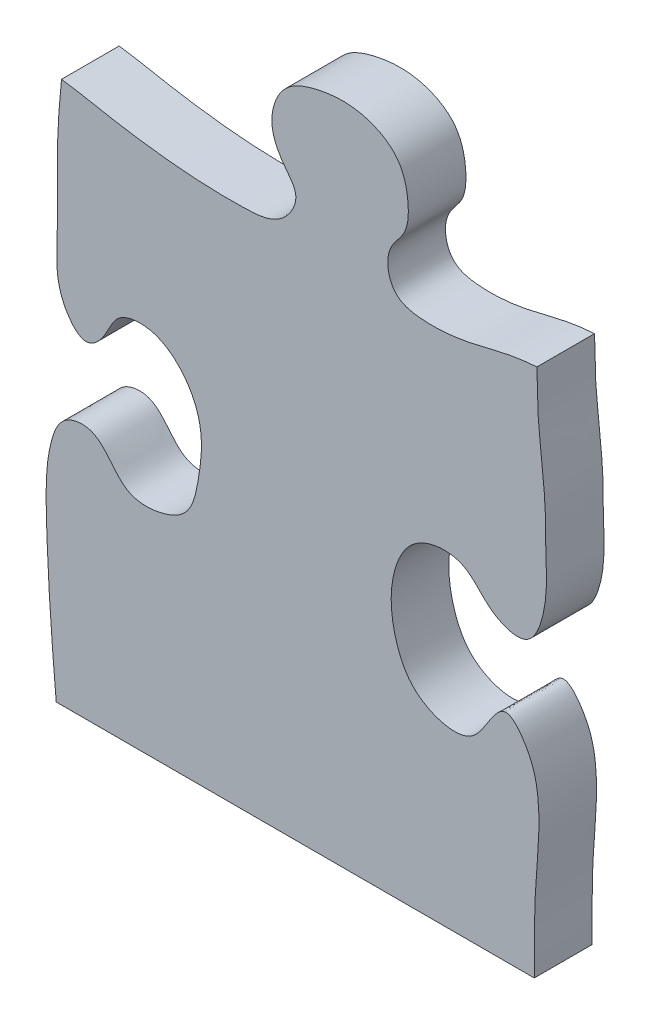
ISO-10303-21;
HEADER;
FILE_DESCRIPTION(('STEP AP214'),'2;1');
FILE_NAME('part.step','',(''),(''),'','','');
FILE_SCHEMA(('AUTOMOTIVE_DESIGN { 1 0 10303 214 1 1 1 1 }'));
ENDSEC;
DATA;
#1=APPLICATION_CONTEXT('core data for automotive mechanical design processes');
#2=APPLICATION_PROTOCOL_DEFINITION('international standard','automotive_design',2000,#1);
#3=PRODUCT_CONTEXT('',#1,'mechanical');
#4=PRODUCT('Part','Part','',(#3));
#5=PRODUCT_RELATED_PRODUCT_CATEGORY('part','',(#4));
#6=PRODUCT_DEFINITION_FORMATION('','',#4);
#7=PRODUCT_DEFINITION_CONTEXT('part definition',#1,'design');
#8=PRODUCT_DEFINITION('design','',#6,#7);
#9=PRODUCT_DEFINITION_SHAPE('','',#8);
#10=(LENGTH_UNIT() NAMED_UNIT(*) SI_UNIT(.MILLI.,.METRE.));
#11=(NAMED_UNIT(*) PLANE_ANGLE_UNIT() SI_UNIT($,.RADIAN.));
#12=(NAMED_UNIT(*) SI_UNIT($,.STERADIAN.) SOLID_ANGLE_UNIT());
#13=UNCERTAINTY_MEASURE_WITH_UNIT(LENGTH_MEASURE(1.E-05),#10,'distance_accuracy_value','');
#14=(GEOMETRIC_REPRESENTATION_CONTEXT(3) GLOBAL_UNCERTAINTY_ASSIGNED_CONTEXT((#13)) GLOBAL_UNIT_ASSIGNED_CONTEXT((#10,
#11,#12)) REPRESENTATION_CONTEXT('',''));
#15=CARTESIAN_POINT('',(0.,0.,0.));
#16=DIRECTION('',(0.,0.,1.));
#17=DIRECTION('',(1.,0.,0.));
#18=AXIS2_PLACEMENT_3D('',#15,#16,#17);
#19=CARTESIAN_POINT('',(-186.393246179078,356.,-0.00999999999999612));
#20=CARTESIAN_POINT('',(-186.465644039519,346.788250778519,-0.00999999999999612));
#21=CARTESIAN_POINT('',(-188.628884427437,329.478394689,-0.00999999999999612));
#22=CARTESIAN_POINT('',(-190.429976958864,304.816732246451,-0.00999999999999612));
#23=CARTESIAN_POINT('',(-187.884620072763,287.022607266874,-0.00999999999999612));
#24=CARTESIAN_POINT('',(-177.83183487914,273.701157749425,-0.00999999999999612));
#25=CARTESIAN_POINT('',(-167.372440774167,281.069990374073,-0.00999999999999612));
#26=CARTESIAN_POINT('',(-162.424812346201,293.671302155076,-0.00999999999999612));
#27=CARTESIAN_POINT('',(-138.980403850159,295.954762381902,-0.00999999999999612));
#28=CARTESIAN_POINT('',(-129.023505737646,274.502332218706,-0.00999999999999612));
#29=CARTESIAN_POINT('',(-130.151753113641,256.130310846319,-0.00999999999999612));
#30=CARTESIAN_POINT('',(-138.180313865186,240.882815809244,-0.00999999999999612));
#31=CARTESIAN_POINT('',(-153.903325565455,237.974697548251,-0.00999999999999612));
#32=CARTESIAN_POINT('',(-162.781582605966,247.270783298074,-0.00999999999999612));
#33=CARTESIAN_POINT('',(-171.61954140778,254.983724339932,-0.00999999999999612));
#34=CARTESIAN_POINT('',(-186.267660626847,251.663377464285,-0.00999999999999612));
#35=CARTESIAN_POINT('',(-188.178219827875,226.271427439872,-0.00999999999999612));
#36=CARTESIAN_POINT('',(-186.828985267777,214.10322906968,-0.00999999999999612));
#37=CARTESIAN_POINT('',(-182.631402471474,181.666904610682,-0.00999999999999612));
#38=CARTESIAN_POINT('',(-187.119801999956,157.75465666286,-0.00999999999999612));
#39=CARTESIAN_POINT('',(-187.457937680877,142.904539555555,-0.00999999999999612));
#40=CARTESIAN_POINT('',(-184.089404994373,126.204275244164,-0.00999999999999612));
#41=CARTESIAN_POINT('',(-168.499206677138,126.488047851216,-0.00999999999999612));
#42=CARTESIAN_POINT('',(-158.423592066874,136.759079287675,-0.00999999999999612));
#43=CARTESIAN_POINT('',(-133.598254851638,130.460350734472,-0.00999999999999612));
#44=CARTESIAN_POINT('',(-132.174041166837,109.25711139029,-0.00999999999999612));
#45=CARTESIAN_POINT('',(-137.401430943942,84.0677449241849,-0.00999999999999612));
#46=CARTESIAN_POINT('',(-159.905312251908,82.8448138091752,-0.00999999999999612));
#47=CARTESIAN_POINT('',(-167.594499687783,95.2630828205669,-0.00999999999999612));
#48=CARTESIAN_POINT('',(-184.064608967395,90.371493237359,-0.00999999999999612));
#49=CARTESIAN_POINT('',(-186.999172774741,63.1173196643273,-0.00999999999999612));
#50=CARTESIAN_POINT('',(-188.17555036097,34.3474510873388,-0.00999999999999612));
#51=CARTESIAN_POINT('',(-189.520016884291,-1.94344937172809,-0.00999999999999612));
#52=CARTESIAN_POINT('',(-192.230906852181,-38.9111914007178,-0.00999999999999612));
#53=CARTESIAN_POINT('',(-193.196462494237,-56.4819013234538,-0.00999999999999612));
#54=CARTESIAN_POINT('',(-187.787083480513,-81.0819408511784,-0.00999999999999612));
#55=CARTESIAN_POINT('',(-174.027975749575,-78.613025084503,-0.00999999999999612));
#56=CARTESIAN_POINT('',(-167.64120428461,-66.7586676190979,-0.00999999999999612));
#57=CARTESIAN_POINT('',(-138.878579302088,-69.8200733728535,-0.00999999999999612));
#58=CARTESIAN_POINT('',(-138.315063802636,-94.39593724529,-0.00999999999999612));
#59=CARTESIAN_POINT('',(-145.951566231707,-114.49908529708,-0.00999999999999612));
#60=CARTESIAN_POINT('',(-163.555921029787,-121.175747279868,-0.00999999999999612));
#61=CARTESIAN_POINT('',(-172.11578880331,-114.919909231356,-0.00999999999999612));
#62=CARTESIAN_POINT('',(-176.485425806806,-107.364168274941,-0.00999999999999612));
#63=CARTESIAN_POINT('',(-184.309097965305,-107.607264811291,-0.00999999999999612));
#64=CARTESIAN_POINT('',(-188.561946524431,-116.100575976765,-0.00999999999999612));
#65=CARTESIAN_POINT('',(-189.834439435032,-132.751458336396,-0.00999999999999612));
#66=CARTESIAN_POINT('',(-188.899668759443,-143.69775261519,-0.00999999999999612));
#67=CARTESIAN_POINT('',(-186.87437190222,-176.639875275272,-0.00999999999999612));
#68=CARTESIAN_POINT('',(-187.115886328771,-188.95785352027,-0.00999999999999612));
#69=CARTESIAN_POINT('',(-184.068917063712,-208.490912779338,-0.00999999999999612));
#70=CARTESIAN_POINT('',(-184.462371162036,-228.434350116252,-0.00999999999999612));
#71=CARTESIAN_POINT('',(-182.717405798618,-241.744671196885,-0.00999999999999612));
#72=CARTESIAN_POINT('',(-190.107123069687,-258.646375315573,-0.00999999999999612));
#73=CARTESIAN_POINT('',(-204.50360377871,-253.849993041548,-0.00999999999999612));
#74=CARTESIAN_POINT('',(-211.768269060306,-241.698033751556,-0.00999999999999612));
#75=CARTESIAN_POINT('',(-230.141572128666,-243.165284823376,-0.00999999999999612));
#76=CARTESIAN_POINT('',(-238.864067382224,-259.702852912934,-0.00999999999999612));
#77=CARTESIAN_POINT('',(-237.82033634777,-276.944530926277,-0.00999999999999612));
#78=CARTESIAN_POINT('',(-229.688332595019,-293.402921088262,-0.00999999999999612));
#79=CARTESIAN_POINT('',(-210.804716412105,-298.51720908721,-0.00999999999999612));
#80=CARTESIAN_POINT('',(-204.725260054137,-287.600226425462,-0.00999999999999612));
#81=CARTESIAN_POINT('',(-198.130842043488,-278.388409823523,-0.00999999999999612));
#82=CARTESIAN_POINT('',(-189.724281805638,-288.428094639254,-0.00999999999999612));
#83=CARTESIAN_POINT('',(-185.110914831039,-304.121783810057,-0.00999999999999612));
#84=CARTESIAN_POINT('',(-188.504639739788,-328.326605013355,-0.00999999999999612));
#85=CARTESIAN_POINT('',(-188.031330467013,-347.655914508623,-0.00999999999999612));
#86=CARTESIAN_POINT('',(-188.197680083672,-356.,-0.00999999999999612));
#87=B_SPLINE_CURVE_WITH_KNOTS('',3,(#19,#20,#21,#22,#23,#24,#25,#26,#27,#28,#29,#30,#31,#32,#33,
#34,#35,#36,#37,#38,#39,#40,#41,#42,#43,#44,#45,#46,#47,#48,#49,#50,#51,#52,#53,#54,#55,#56,#57,
#58,#59,#60,#61,#62,#63,#64,#65,#66,#67,#68,#69,#70,#71,#72,#73,#74,#75,#76,#77,#78,#79,#80,#81,
#82,#83,#84,#85,#86),.UNSPECIFIED.,.F.,.F.,(4,1,1,1,1,1,1,1,1,1,1,1,1,1,1,1,1,1,1,1,1,1,1,1,1,1,
1,1,1,1,1,1,1,1,1,1,1,1,1,1,1,1,1,1,1,1,1,1,1,1,1,1,1,1,1,1,1,1,1,1,1,1,1,1,1,4),(0.,
0.0262331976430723,0.050560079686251,0.0695219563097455,0.0800713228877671,0.0885051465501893,
0.099482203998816,0.118619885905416,0.138837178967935,0.157899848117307,0.171291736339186,
0.185151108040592,0.19559453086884,0.206745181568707,0.217337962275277,0.230877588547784,
0.26409725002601,0.28835141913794,0.305292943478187,0.32505690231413,0.334743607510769,
0.348191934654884,0.358741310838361,0.375812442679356,0.401272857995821,0.416827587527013,
0.432882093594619,0.444490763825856,0.458014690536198,0.481063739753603,0.510647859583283,
0.548186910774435,0.587648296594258,0.610908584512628,0.621783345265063,0.631931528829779,
0.643591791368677,0.658807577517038,0.686126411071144,0.703957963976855,0.718649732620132,
0.731300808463,0.735266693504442,0.736591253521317,0.743662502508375,0.746501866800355,
0.76410099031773,0.785041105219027,0.790214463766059,0.812987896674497,0.817887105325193,
0.836359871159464,0.84408330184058,0.853053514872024,0.86313504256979,0.875355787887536,
0.885829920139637,0.902341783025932,0.912788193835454,0.926625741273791,0.934943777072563,
0.940543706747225,0.946912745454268,0.957064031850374,0.980148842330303,1.),.UNSPECIFIED.);
#88=DIRECTION('',(0.,0.,1.));
#89=VECTOR('',#88,1.);
#90=SURFACE_OF_LINEAR_EXTRUSION('',#87,#89);
#91=CARTESIAN_POINT('',(-186.393246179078,356.,20.));
#92=CARTESIAN_POINT('',(-186.465644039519,346.788250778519,20.));
#93=CARTESIAN_POINT('',(-188.628884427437,329.478394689,20.));
#94=CARTESIAN_POINT('',(-190.429976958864,304.816732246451,20.));
#95=CARTESIAN_POINT('',(-187.884620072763,287.022607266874,20.));
#96=CARTESIAN_POINT('',(-177.83183487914,273.701157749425,20.));
#97=CARTESIAN_POINT('',(-167.372440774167,281.069990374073,20.));
#98=CARTESIAN_POINT('',(-162.424812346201,293.671302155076,20.));
#99=CARTESIAN_POINT('',(-138.980403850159,295.954762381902,20.));
#100=CARTESIAN_POINT('',(-129.023505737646,274.502332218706,20.));
#101=CARTESIAN_POINT('',(-130.151753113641,256.130310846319,20.));
#102=CARTESIAN_POINT('',(-138.180313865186,240.882815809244,20.));
#103=CARTESIAN_POINT('',(-153.903325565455,237.974697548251,20.));
#104=CARTESIAN_POINT('',(-162.781582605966,247.270783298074,20.));
#105=CARTESIAN_POINT('',(-171.61954140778,254.983724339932,20.));
#106=CARTESIAN_POINT('',(-186.267660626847,251.663377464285,20.));
#107=CARTESIAN_POINT('',(-188.178219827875,226.271427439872,20.));
#108=CARTESIAN_POINT('',(-186.828985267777,214.10322906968,20.));
#109=CARTESIAN_POINT('',(-182.631402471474,181.666904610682,20.));
#110=CARTESIAN_POINT('',(-187.119801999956,157.75465666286,20.));
#111=CARTESIAN_POINT('',(-187.457937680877,142.904539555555,20.));
#112=CARTESIAN_POINT('',(-184.089404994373,126.204275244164,20.));
#113=CARTESIAN_POINT('',(-168.499206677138,126.488047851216,20.));
#114=CARTESIAN_POINT('',(-158.423592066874,136.759079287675,20.));
#115=CARTESIAN_POINT('',(-133.598254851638,130.460350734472,20.));
#116=CARTESIAN_POINT('',(-132.174041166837,109.25711139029,20.));
#117=CARTESIAN_POINT('',(-137.401430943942,84.0677449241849,20.));
#118=CARTESIAN_POINT('',(-159.905312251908,82.8448138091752,20.));
#119=CARTESIAN_POINT('',(-167.594499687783,95.2630828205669,20.));
#120=CARTESIAN_POINT('',(-184.064608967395,90.371493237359,20.));
#121=CARTESIAN_POINT('',(-186.999172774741,63.1173196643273,20.));
#122=CARTESIAN_POINT('',(-188.17555036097,34.3474510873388,20.));
#123=CARTESIAN_POINT('',(-189.520016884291,-1.94344937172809,20.));
#124=CARTESIAN_POINT('',(-192.230906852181,-38.9111914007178,20.));
#125=CARTESIAN_POINT('',(-193.196462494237,-56.4819013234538,20.));
#126=CARTESIAN_POINT('',(-187.787083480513,-81.0819408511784,20.));
#127=CARTESIAN_POINT('',(-174.027975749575,-78.613025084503,20.));
#128=CARTESIAN_POINT('',(-167.64120428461,-66.7586676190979,20.));
#129=CARTESIAN_POINT('',(-138.878579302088,-69.8200733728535,20.));
#130=CARTESIAN_POINT('',(-138.315063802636,-94.39593724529,20.));
#131=CARTESIAN_POINT('',(-145.951566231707,-114.49908529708,20.));
#132=CARTESIAN_POINT('',(-163.555921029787,-121.175747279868,20.));
#133=CARTESIAN_POINT('',(-172.11578880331,-114.919909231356,20.));
#134=CARTESIAN_POINT('',(-176.485425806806,-107.364168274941,20.));
#135=CARTESIAN_POINT('',(-184.309097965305,-107.607264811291,20.));
#136=CARTESIAN_POINT('',(-188.561946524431,-116.100575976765,20.));
#137=CARTESIAN_POINT('',(-189.834439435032,-132.751458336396,20.));
#138=CARTESIAN_POINT('',(-188.899668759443,-143.69775261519,20.));
#139=CARTESIAN_POINT('',(-186.87437190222,-176.639875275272,20.));
#140=CARTESIAN_POINT('',(-187.115886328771,-188.95785352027,20.));
#141=CARTESIAN_POINT('',(-184.068917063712,-208.490912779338,20.));
#142=CARTESIAN_POINT('',(-184.462371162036,-228.434350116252,20.));
#143=CARTESIAN_POINT('',(-182.717405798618,-241.744671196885,20.));
#144=CARTESIAN_POINT('',(-190.107123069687,-258.646375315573,20.));
#145=CARTESIAN_POINT('',(-204.50360377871,-253.849993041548,20.));
#146=CARTESIAN_POINT('',(-211.768269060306,-241.698033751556,20.));
#147=CARTESIAN_POINT('',(-230.141572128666,-243.165284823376,20.));
#148=CARTESIAN_POINT('',(-238.864067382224,-259.702852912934,20.));
#149=CARTESIAN_POINT('',(-237.82033634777,-276.944530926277,20.));
#150=CARTESIAN_POINT('',(-229.688332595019,-293.402921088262,20.));
#151=CARTESIAN_POINT('',(-210.804716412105,-298.51720908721,20.));
#152=CARTESIAN_POINT('',(-204.725260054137,-287.600226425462,20.));
#153=CARTESIAN_POINT('',(-198.130842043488,-278.388409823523,20.));
#154=CARTESIAN_POINT('',(-189.724281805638,-288.428094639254,20.));
#155=CARTESIAN_POINT('',(-185.110914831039,-304.121783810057,20.));
#156=CARTESIAN_POINT('',(-188.504639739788,-328.326605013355,20.));
#157=CARTESIAN_POINT('',(-188.031330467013,-347.655914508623,20.));
#158=CARTESIAN_POINT('',(-188.197680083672,-356.,20.));
#159=B_SPLINE_CURVE_WITH_KNOTS('',3,(#91,#92,#93,#94,#95,#96,#97,#98,#99,#100,#101,#102,#103,
#104,#105,#106,#107,#108,#109,#110,#111,#112,#113,#114,#115,#116,#117,#118,#119,#120,#121,#122,
#123,#124,#125,#126,#127,#128,#129,#130,#131,#132,#133,#134,#135,#136,#137,#138,#139,#140,#141,
#142,#143,#144,#145,#146,#147,#148,#149,#150,#151,#152,#153,#154,#155,#156,#157,#158),
.UNSPECIFIED.,.F.,.F.,(4,1,1,1,1,1,1,1,1,1,1,1,1,1,1,1,1,1,1,1,1,1,1,1,1,1,1,1,1,1,1,1,1,1,1,1,
1,1,1,1,1,1,1,1,1,1,1,1,1,1,1,1,1,1,1,1,1,1,1,1,1,1,1,1,1,4),(0.,0.0262331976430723,
0.050560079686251,0.0695219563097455,0.0800713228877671,0.0885051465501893,0.099482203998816,
0.118619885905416,0.138837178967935,0.157899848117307,0.171291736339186,0.185151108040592,
0.19559453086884,0.206745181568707,0.217337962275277,0.230877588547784,0.26409725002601,
0.28835141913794,0.305292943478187,0.32505690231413,0.334743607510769,0.348191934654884,
0.358741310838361,0.375812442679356,0.401272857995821,0.416827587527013,0.432882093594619,
0.444490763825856,0.458014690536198,0.481063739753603,0.510647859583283,0.548186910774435,
0.587648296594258,0.610908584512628,0.621783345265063,0.631931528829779,0.643591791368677,
0.658807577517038,0.686126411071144,0.703957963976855,0.718649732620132,0.731300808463,
0.735266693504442,0.736591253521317,0.743662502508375,0.746501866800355,0.76410099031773,
0.785041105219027,0.790214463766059,0.812987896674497,0.817887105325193,0.836359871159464,
0.84408330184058,0.853053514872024,0.86313504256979,0.875355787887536,0.885829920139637,
0.902341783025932,0.912788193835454,0.926625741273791,0.934943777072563,0.940543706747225,
0.946912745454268,0.957064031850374,0.980148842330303,1.),.UNSPECIFIED.);
#160=CARTESIAN_POINT('',(-187.287524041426,-171.956059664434,20.));
#161=VERTEX_POINT('',#160);
#162=CARTESIAN_POINT('',(-188.197680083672,-356.,20.));
#163=VERTEX_POINT('',#162);
#164=EDGE_CURVE('E94',#161,#163,#159,.T.);
#165=ORIENTED_EDGE('',*,*,#164,.T.);
#166=DIRECTION('',(0.,0.,1.));
#167=VECTOR('',#166,1.);
#168=CARTESIAN_POINT('',(-188.197680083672,-356.,-0.00999999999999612));
#169=LINE('',#168,#167);
#170=CARTESIAN_POINT('',(-188.197680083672,-356.,0.));
#171=VERTEX_POINT('',#170);
#172=EDGE_CURVE('E110',#171,#163,#169,.T.);
#173=ORIENTED_EDGE('',*,*,#172,.F.);
#174=CARTESIAN_POINT('',(-186.393246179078,356.,0.));
#175=CARTESIAN_POINT('',(-186.465644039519,346.788250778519,0.));
#176=CARTESIAN_POINT('',(-188.628884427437,329.478394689,0.));
#177=CARTESIAN_POINT('',(-190.429976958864,304.816732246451,0.));
#178=CARTESIAN_POINT('',(-187.884620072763,287.022607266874,0.));
#179=CARTESIAN_POINT('',(-177.83183487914,273.701157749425,0.));
#180=CARTESIAN_POINT('',(-167.372440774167,281.069990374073,0.));
#181=CARTESIAN_POINT('',(-162.424812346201,293.671302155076,0.));
#182=CARTESIAN_POINT('',(-138.980403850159,295.954762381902,0.));
#183=CARTESIAN_POINT('',(-129.023505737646,274.502332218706,0.));
#184=CARTESIAN_POINT('',(-130.151753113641,256.130310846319,0.));
#185=CARTESIAN_POINT('',(-138.180313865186,240.882815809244,0.));
#186=CARTESIAN_POINT('',(-153.903325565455,237.974697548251,0.));
#187=CARTESIAN_POINT('',(-162.781582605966,247.270783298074,0.));
#188=CARTESIAN_POINT('',(-171.61954140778,254.983724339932,0.));
#189=CARTESIAN_POINT('',(-186.267660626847,251.663377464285,0.));
#190=CARTESIAN_POINT('',(-188.178219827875,226.271427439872,0.));
#191=CARTESIAN_POINT('',(-186.828985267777,214.10322906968,0.));
#192=CARTESIAN_POINT('',(-182.631402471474,181.666904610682,0.));
#193=CARTESIAN_POINT('',(-187.119801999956,157.75465666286,0.));
#194=CARTESIAN_POINT('',(-187.457937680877,142.904539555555,0.));
#195=CARTESIAN_POINT('',(-184.089404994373,126.204275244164,0.));
#196=CARTESIAN_POINT('',(-168.499206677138,126.488047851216,0.));
#197=CARTESIAN_POINT('',(-158.423592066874,136.759079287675,0.));
#198=CARTESIAN_POINT('',(-133.598254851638,130.460350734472,0.));
#199=CARTESIAN_POINT('',(-132.174041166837,109.25711139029,0.));
#200=CARTESIAN_POINT('',(-137.401430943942,84.0677449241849,0.));
#201=CARTESIAN_POINT('',(-159.905312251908,82.8448138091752,0.));
#202=CARTESIAN_POINT('',(-167.594499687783,95.2630828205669,0.));
#203=CARTESIAN_POINT('',(-184.064608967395,90.371493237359,0.));
#204=CARTESIAN_POINT('',(-186.999172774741,63.1173196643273,0.));
#205=CARTESIAN_POINT('',(-188.17555036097,34.3474510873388,0.));
#206=CARTESIAN_POINT('',(-189.520016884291,-1.94344937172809,0.));
#207=CARTESIAN_POINT('',(-192.230906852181,-38.9111914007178,0.));
#208=CARTESIAN_POINT('',(-193.196462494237,-56.4819013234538,0.));
#209=CARTESIAN_POINT('',(-187.787083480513,-81.0819408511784,0.));
#210=CARTESIAN_POINT('',(-174.027975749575,-78.613025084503,0.));
#211=CARTESIAN_POINT('',(-167.64120428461,-66.7586676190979,0.));
#212=CARTESIAN_POINT('',(-138.878579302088,-69.8200733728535,0.));
#213=CARTESIAN_POINT('',(-138.315063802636,-94.39593724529,0.));
#214=CARTESIAN_POINT('',(-145.951566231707,-114.49908529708,0.));
#215=CARTESIAN_POINT('',(-163.555921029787,-121.175747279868,0.));
#216=CARTESIAN_POINT('',(-172.11578880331,-114.919909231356,0.));
#217=CARTESIAN_POINT('',(-176.485425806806,-107.364168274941,0.));
#218=CARTESIAN_POINT('',(-184.309097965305,-107.607264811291,0.));
#219=CARTESIAN_POINT('',(-188.561946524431,-116.100575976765,0.));
#220=CARTESIAN_POINT('',(-189.834439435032,-132.751458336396,0.));
#221=CARTESIAN_POINT('',(-188.899668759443,-143.69775261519,0.));
#222=CARTESIAN_POINT('',(-186.87437190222,-176.639875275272,0.));
#223=CARTESIAN_POINT('',(-187.115886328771,-188.95785352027,0.));
#224=CARTESIAN_POINT('',(-184.068917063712,-208.490912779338,0.));
#225=CARTESIAN_POINT('',(-184.462371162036,-228.434350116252,0.));
#226=CARTESIAN_POINT('',(-182.717405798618,-241.744671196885,0.));
#227=CARTESIAN_POINT('',(-190.107123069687,-258.646375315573,0.));
#228=CARTESIAN_POINT('',(-204.50360377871,-253.849993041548,0.));
#229=CARTESIAN_POINT('',(-211.768269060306,-241.698033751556,0.));
#230=CARTESIAN_POINT('',(-230.141572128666,-243.165284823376,0.));
#231=CARTESIAN_POINT('',(-238.864067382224,-259.702852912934,0.));
#232=CARTESIAN_POINT('',(-237.82033634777,-276.944530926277,0.));
#233=CARTESIAN_POINT('',(-229.688332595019,-293.402921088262,0.));
#234=CARTESIAN_POINT('',(-210.804716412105,-298.51720908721,0.));
#235=CARTESIAN_POINT('',(-204.725260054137,-287.600226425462,0.));
#236=CARTESIAN_POINT('',(-198.130842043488,-278.388409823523,0.));
#237=CARTESIAN_POINT('',(-189.724281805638,-288.428094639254,0.));
#238=CARTESIAN_POINT('',(-185.110914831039,-304.121783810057,0.));
#239=CARTESIAN_POINT('',(-188.504639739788,-328.326605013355,0.));
#240=CARTESIAN_POINT('',(-188.031330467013,-347.655914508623,0.));
#241=CARTESIAN_POINT('',(-188.197680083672,-356.,0.));
#242=B_SPLINE_CURVE_WITH_KNOTS('',3,(#174,#175,#176,#177,#178,#179,#180,#181,#182,#183,#184,
#185,#186,#187,#188,#189,#190,#191,#192,#193,#194,#195,#196,#197,#198,#199,#200,#201,#202,#203,
#204,#205,#206,#207,#208,#209,#210,#211,#212,#213,#214,#215,#216,#217,#218,#219,#220,#221,#222,
#223,#224,#225,#226,#227,#228,#229,#230,#231,#232,#233,#234,#235,#236,#237,#238,#239,#240,#241),
.UNSPECIFIED.,.F.,.F.,(4,1,1,1,1,1,1,1,1,1,1,1,1,1,1,1,1,1,1,1,1,1,1,1,1,1,1,1,1,1,1,1,1,1,1,1,
1,1,1,1,1,1,1,1,1,1,1,1,1,1,1,1,1,1,1,1,1,1,1,1,1,1,1,1,1,4),(0.,0.0262331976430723,
0.050560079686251,0.0695219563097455,0.0800713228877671,0.0885051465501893,0.099482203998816,
0.118619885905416,0.138837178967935,0.157899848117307,0.171291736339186,0.185151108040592,
0.19559453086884,0.206745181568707,0.217337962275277,0.230877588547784,0.26409725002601,
0.28835141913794,0.305292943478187,0.32505690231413,0.334743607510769,0.348191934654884,
0.358741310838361,0.375812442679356,0.401272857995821,0.416827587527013,0.432882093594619,
0.444490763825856,0.458014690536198,0.481063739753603,0.510647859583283,0.548186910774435,
0.587648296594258,0.610908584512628,0.621783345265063,0.631931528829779,0.643591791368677,
0.658807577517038,0.686126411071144,0.703957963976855,0.718649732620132,0.731300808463,
0.735266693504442,0.736591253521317,0.743662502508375,0.746501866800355,0.76410099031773,
0.785041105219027,0.790214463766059,0.812987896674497,0.817887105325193,0.836359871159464,
0.84408330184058,0.853053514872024,0.86313504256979,0.875355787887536,0.885829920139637,
0.902341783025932,0.912788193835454,0.926625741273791,0.934943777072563,0.940543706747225,
0.946912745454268,0.957064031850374,0.980148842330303,1.),.UNSPECIFIED.);
#243=CARTESIAN_POINT('',(-187.287524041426,-171.956059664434,0.));
#244=VERTEX_POINT('',#243);
#245=EDGE_CURVE('E59',#244,#171,#242,.T.);
#246=ORIENTED_EDGE('',*,*,#245,.F.);
#247=DIRECTION('',(0.,0.,1.));
#248=VECTOR('',#247,1.);
#249=CARTESIAN_POINT('',(-187.287524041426,-171.956059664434,-0.00999999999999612));
#250=LINE('',#249,#248);
#251=EDGE_CURVE('E52',#161,#244,#250,.F.);
#252=ORIENTED_EDGE('',*,*,#251,.F.);
#253=EDGE_LOOP('',(#165,#173,#246,#252));
#254=FACE_BOUND('',#253,.T.);
#255=ADVANCED_FACE('F34',(#254),#90,.F.);
#256=CARTESIAN_POINT('',(-352.534626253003,356.,-0.00999999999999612));
#257=CARTESIAN_POINT('',(-353.877781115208,341.802611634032,-0.00999999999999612));
#258=CARTESIAN_POINT('',(-351.460483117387,322.567956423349,-0.00999999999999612));
#259=CARTESIAN_POINT('',(-355.747404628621,299.493999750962,-0.00999999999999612));
#260=CARTESIAN_POINT('',(-347.645743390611,289.357079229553,-0.00999999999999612));
#261=CARTESIAN_POINT('',(-337.80105524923,293.322704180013,-0.00999999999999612));
#262=CARTESIAN_POINT('',(-331.763521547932,304.464683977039,-0.00999999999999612));
#263=CARTESIAN_POINT('',(-312.737993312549,300.417040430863,-0.00999999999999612));
#264=CARTESIAN_POINT('',(-304.311514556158,284.867329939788,-0.00999999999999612));
#265=CARTESIAN_POINT('',(-301.362858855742,267.518539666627,-0.00999999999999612));
#266=CARTESIAN_POINT('',(-309.525260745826,253.299800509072,-0.00999999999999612));
#267=CARTESIAN_POINT('',(-323.085028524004,249.130779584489,-0.00999999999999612));
#268=CARTESIAN_POINT('',(-333.558735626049,254.453066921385,-0.00999999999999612));
#269=CARTESIAN_POINT('',(-338.061007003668,263.306234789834,-0.00999999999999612));
#270=CARTESIAN_POINT('',(-357.610347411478,266.663664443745,-0.00999999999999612));
#271=CARTESIAN_POINT('',(-352.91397083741,227.568949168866,-0.00999999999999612));
#272=CARTESIAN_POINT('',(-349.689076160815,203.209436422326,-0.00999999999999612));
#273=CARTESIAN_POINT('',(-346.386977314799,175.800103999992,-0.00999999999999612));
#274=CARTESIAN_POINT('',(-343.691373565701,150.269708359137,-0.00999999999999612));
#275=CARTESIAN_POINT('',(-342.931567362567,128.594211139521,-0.00999999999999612));
#276=CARTESIAN_POINT('',(-343.655360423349,107.633085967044,-0.00999999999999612));
#277=CARTESIAN_POINT('',(-357.389603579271,103.824438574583,-0.00999999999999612));
#278=CARTESIAN_POINT('',(-367.576419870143,106.015828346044,-0.00999999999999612));
#279=CARTESIAN_POINT('',(-371.765750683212,114.589953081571,-0.00999999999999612));
#280=CARTESIAN_POINT('',(-382.535012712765,116.182843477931,-0.00999999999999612));
#281=CARTESIAN_POINT('',(-394.783984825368,115.916744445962,-0.00999999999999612));
#282=CARTESIAN_POINT('',(-402.322369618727,104.396558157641,-0.00999999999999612));
#283=CARTESIAN_POINT('',(-405.688784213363,89.1486295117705,-0.00999999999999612));
#284=CARTESIAN_POINT('',(-402.964002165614,71.2455616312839,-0.00999999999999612));
#285=CARTESIAN_POINT('',(-389.022909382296,60.8761001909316,-0.00999999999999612));
#286=CARTESIAN_POINT('',(-377.013010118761,63.0649709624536,-0.00999999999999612));
#287=CARTESIAN_POINT('',(-370.136212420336,70.9200889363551,-0.00999999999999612));
#288=CARTESIAN_POINT('',(-359.248489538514,74.3793713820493,-0.00999999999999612));
#289=CARTESIAN_POINT('',(-347.964757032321,70.4189230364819,-0.00999999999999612));
#290=CARTESIAN_POINT('',(-342.961480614,58.8762689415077,-0.00999999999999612));
#291=CARTESIAN_POINT('',(-344.957853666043,42.6141567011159,-0.00999999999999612));
#292=CARTESIAN_POINT('',(-348.090347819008,20.9428011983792,-0.00999999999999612));
#293=CARTESIAN_POINT('',(-348.787112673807,-1.92187291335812,-0.00999999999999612));
#294=CARTESIAN_POINT('',(-347.063507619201,-23.1354473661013,-0.00999999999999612));
#295=CARTESIAN_POINT('',(-345.803834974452,-40.1989543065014,-0.00999999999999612));
#296=CARTESIAN_POINT('',(-346.365109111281,-52.5147126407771,-0.00999999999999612));
#297=CARTESIAN_POINT('',(-346.987719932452,-61.0081322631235,-0.00999999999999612));
#298=CARTESIAN_POINT('',(-354.605588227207,-67.8105997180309,-0.00999999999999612));
#299=CARTESIAN_POINT('',(-368.483652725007,-69.9483525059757,-0.00999999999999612));
#300=CARTESIAN_POINT('',(-374.929468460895,-56.6181815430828,-0.00999999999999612));
#301=CARTESIAN_POINT('',(-389.51528778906,-54.9578642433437,-0.00999999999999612));
#302=CARTESIAN_POINT('',(-403.927113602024,-62.7741481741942,-0.00999999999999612));
#303=CARTESIAN_POINT('',(-408.906740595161,-79.6272624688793,-0.00999999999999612));
#304=CARTESIAN_POINT('',(-407.354009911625,-95.181625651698,-0.00999999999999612));
#305=CARTESIAN_POINT('',(-399.108136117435,-108.127376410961,-0.00999999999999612));
#306=CARTESIAN_POINT('',(-382.721304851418,-112.332091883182,-0.00999999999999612));
#307=CARTESIAN_POINT('',(-372.627066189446,-99.6029758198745,-0.00999999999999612));
#308=CARTESIAN_POINT('',(-359.245942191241,-98.6507630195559,-0.00999999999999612));
#309=CARTESIAN_POINT('',(-346.811479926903,-105.357996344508,-0.00999999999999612));
#310=CARTESIAN_POINT('',(-347.06309899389,-122.824759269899,-0.00999999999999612));
#311=CARTESIAN_POINT('',(-349.512128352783,-142.867981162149,-0.00999999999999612));
#312=CARTESIAN_POINT('',(-351.967561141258,-164.813498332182,-0.00999999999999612));
#313=CARTESIAN_POINT('',(-354.173348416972,-189.531702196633,-0.00999999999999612));
#314=CARTESIAN_POINT('',(-353.048503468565,-212.668893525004,-0.00999999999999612));
#315=CARTESIAN_POINT('',(-354.739062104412,-232.840407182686,-0.00999999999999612));
#316=CARTESIAN_POINT('',(-344.245211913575,-244.921596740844,-0.00999999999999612));
#317=CARTESIAN_POINT('',(-336.376475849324,-237.735778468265,-0.00999999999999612));
#318=CARTESIAN_POINT('',(-333.938993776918,-228.321764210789,-0.00999999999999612));
#319=CARTESIAN_POINT('',(-321.423877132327,-226.689197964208,-0.00999999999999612));
#320=CARTESIAN_POINT('',(-310.83224361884,-232.911014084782,-0.00999999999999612));
#321=CARTESIAN_POINT('',(-302.540379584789,-246.611975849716,-0.00999999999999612));
#322=CARTESIAN_POINT('',(-304.049270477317,-262.348985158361,-0.00999999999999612));
#323=CARTESIAN_POINT('',(-307.19247660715,-276.895908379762,-0.00999999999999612));
#324=CARTESIAN_POINT('',(-317.916754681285,-281.774853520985,-0.00999999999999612));
#325=CARTESIAN_POINT('',(-328.48323529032,-282.130896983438,-0.00999999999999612));
#326=CARTESIAN_POINT('',(-335.177873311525,-274.391757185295,-0.00999999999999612));
#327=CARTESIAN_POINT('',(-340.967044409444,-267.020526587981,-0.00999999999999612));
#328=CARTESIAN_POINT('',(-352.493784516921,-268.657509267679,-0.00999999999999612));
#329=CARTESIAN_POINT('',(-357.686319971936,-282.822093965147,-0.00999999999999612));
#330=CARTESIAN_POINT('',(-357.597756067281,-311.53856504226,-0.00999999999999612));
#331=CARTESIAN_POINT('',(-355.656952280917,-337.76537977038,-0.00999999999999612));
#332=CARTESIAN_POINT('',(-354.035135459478,-356.,-0.00999999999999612));
#333=B_SPLINE_CURVE_WITH_KNOTS('',3,(#256,#257,#258,#259,#260,#261,#262,#263,#264,#265,#266,
#267,#268,#269,#270,#271,#272,#273,#274,#275,#276,#277,#278,#279,#280,#281,#282,#283,#284,#285,
#286,#287,#288,#289,#290,#291,#292,#293,#294,#295,#296,#297,#298,#299,#300,#301,#302,#303,#304,
#305,#306,#307,#308,#309,#310,#311,#312,#313,#314,#315,#316,#317,#318,#319,#320,#321,#322,#323,
#324,#325,#326,#327,#328,#329,#330,#331,#332),.UNSPECIFIED.,.F.,.F.,(4,1,1,1,1,1,1,1,1,1,1,1,1,
1,1,1,1,1,1,1,1,1,1,1,1,1,1,1,1,1,1,1,1,1,1,1,1,1,1,1,1,1,1,1,1,1,1,1,1,1,1,1,1,1,1,1,1,1,1,1,1,
1,1,1,1,1,1,1,1,1,1,1,1,1,4),(0.,0.0362663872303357,0.0516957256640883,0.0575126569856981,
0.0656061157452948,0.0738542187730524,0.0886191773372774,0.103761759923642,0.118344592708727,
0.132658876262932,0.141706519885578,0.152628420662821,0.159936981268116,0.166346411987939,
0.196099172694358,0.222591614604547,0.242329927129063,0.265519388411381,0.28892287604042,
0.3014399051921,0.313339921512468,0.3200215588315,0.327007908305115,0.335496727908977,
0.346341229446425,0.356695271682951,0.367736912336,0.387395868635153,0.399447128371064,
0.408443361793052,0.416078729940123,0.425886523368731,0.4364139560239,0.44355209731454,
0.456701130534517,0.478081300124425,0.500737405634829,0.515722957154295,0.53328305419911,
0.545176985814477,0.547408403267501,0.555597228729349,0.568417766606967,0.576959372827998,
0.589646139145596,0.601337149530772,0.617107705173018,0.631663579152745,0.64088779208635,
0.655943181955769,0.666193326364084,0.679689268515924,0.687162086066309,0.700019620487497,
0.719317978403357,0.742088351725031,0.756487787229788,0.783860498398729,0.801622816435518,
0.8097052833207,0.815461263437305,0.824516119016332,0.833497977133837,0.842909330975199,
0.85562007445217,0.872330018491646,0.883598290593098,0.890881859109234,0.901363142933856,
0.908021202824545,0.916645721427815,0.924017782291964,0.933106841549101,0.95201687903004,1.),.UNSPECIFIED.);
#334=DIRECTION('',(0.,0.,1.));
#335=VECTOR('',#334,1.);
#336=SURFACE_OF_LINEAR_EXTRUSION('',#333,#335);
#337=CARTESIAN_POINT('',(-352.534626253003,356.,20.));
#338=CARTESIAN_POINT('',(-353.877781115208,341.802611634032,20.));
#339=CARTESIAN_POINT('',(-351.460483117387,322.567956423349,20.));
#340=CARTESIAN_POINT('',(-355.747404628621,299.493999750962,20.));
#341=CARTESIAN_POINT('',(-347.645743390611,289.357079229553,20.));
#342=CARTESIAN_POINT('',(-337.80105524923,293.322704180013,20.));
#343=CARTESIAN_POINT('',(-331.763521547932,304.464683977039,20.));
#344=CARTESIAN_POINT('',(-312.737993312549,300.417040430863,20.));
#345=CARTESIAN_POINT('',(-304.311514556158,284.867329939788,20.));
#346=CARTESIAN_POINT('',(-301.362858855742,267.518539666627,20.));
#347=CARTESIAN_POINT('',(-309.525260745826,253.299800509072,20.));
#348=CARTESIAN_POINT('',(-323.085028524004,249.130779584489,20.));
#349=CARTESIAN_POINT('',(-333.558735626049,254.453066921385,20.));
#350=CARTESIAN_POINT('',(-338.061007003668,263.306234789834,20.));
#351=CARTESIAN_POINT('',(-357.610347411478,266.663664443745,20.));
#352=CARTESIAN_POINT('',(-352.91397083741,227.568949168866,20.));
#353=CARTESIAN_POINT('',(-349.689076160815,203.209436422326,20.));
#354=CARTESIAN_POINT('',(-346.386977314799,175.800103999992,20.));
#355=CARTESIAN_POINT('',(-343.691373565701,150.269708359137,20.));
#356=CARTESIAN_POINT('',(-342.931567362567,128.594211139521,20.));
#357=CARTESIAN_POINT('',(-343.655360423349,107.633085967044,20.));
#358=CARTESIAN_POINT('',(-357.389603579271,103.824438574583,20.));
#359=CARTESIAN_POINT('',(-367.576419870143,106.015828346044,20.));
#360=CARTESIAN_POINT('',(-371.765750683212,114.589953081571,20.));
#361=CARTESIAN_POINT('',(-382.535012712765,116.182843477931,20.));
#362=CARTESIAN_POINT('',(-394.783984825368,115.916744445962,20.));
#363=CARTESIAN_POINT('',(-402.322369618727,104.396558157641,20.));
#364=CARTESIAN_POINT('',(-405.688784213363,89.1486295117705,20.));
#365=CARTESIAN_POINT('',(-402.964002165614,71.2455616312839,20.));
#366=CARTESIAN_POINT('',(-389.022909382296,60.8761001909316,20.));
#367=CARTESIAN_POINT('',(-377.013010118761,63.0649709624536,20.));
#368=CARTESIAN_POINT('',(-370.136212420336,70.9200889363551,20.));
#369=CARTESIAN_POINT('',(-359.248489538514,74.3793713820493,20.));
#370=CARTESIAN_POINT('',(-347.964757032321,70.4189230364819,20.));
#371=CARTESIAN_POINT('',(-342.961480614,58.8762689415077,20.));
#372=CARTESIAN_POINT('',(-344.957853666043,42.6141567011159,20.));
#373=CARTESIAN_POINT('',(-348.090347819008,20.9428011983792,20.));
#374=CARTESIAN_POINT('',(-348.787112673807,-1.92187291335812,20.));
#375=CARTESIAN_POINT('',(-347.063507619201,-23.1354473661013,20.));
#376=CARTESIAN_POINT('',(-345.803834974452,-40.1989543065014,20.));
#377=CARTESIAN_POINT('',(-346.365109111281,-52.5147126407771,20.));
#378=CARTESIAN_POINT('',(-346.987719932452,-61.0081322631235,20.));
#379=CARTESIAN_POINT('',(-354.605588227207,-67.8105997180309,20.));
#380=CARTESIAN_POINT('',(-368.483652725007,-69.9483525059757,20.));
#381=CARTESIAN_POINT('',(-374.929468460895,-56.6181815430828,20.));
#382=CARTESIAN_POINT('',(-389.51528778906,-54.9578642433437,20.));
#383=CARTESIAN_POINT('',(-403.927113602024,-62.7741481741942,20.));
#384=CARTESIAN_POINT('',(-408.906740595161,-79.6272624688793,20.));
#385=CARTESIAN_POINT('',(-407.354009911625,-95.181625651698,20.));
#386=CARTESIAN_POINT('',(-399.108136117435,-108.127376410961,20.));
#387=CARTESIAN_POINT('',(-382.721304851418,-112.332091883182,20.));
#388=CARTESIAN_POINT('',(-372.627066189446,-99.6029758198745,20.));
#389=CARTESIAN_POINT('',(-359.245942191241,-98.6507630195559,20.));
#390=CARTESIAN_POINT('',(-346.811479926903,-105.357996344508,20.));
#391=CARTESIAN_POINT('',(-347.06309899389,-122.824759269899,20.));
#392=CARTESIAN_POINT('',(-349.512128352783,-142.867981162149,20.));
#393=CARTESIAN_POINT('',(-351.967561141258,-164.813498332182,20.));
#394=CARTESIAN_POINT('',(-354.173348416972,-189.531702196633,20.));
#395=CARTESIAN_POINT('',(-353.048503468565,-212.668893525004,20.));
#396=CARTESIAN_POINT('',(-354.739062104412,-232.840407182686,20.));
#397=CARTESIAN_POINT('',(-344.245211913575,-244.921596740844,20.));
#398=CARTESIAN_POINT('',(-336.376475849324,-237.735778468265,20.));
#399=CARTESIAN_POINT('',(-333.938993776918,-228.321764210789,20.));
#400=CARTESIAN_POINT('',(-321.423877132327,-226.689197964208,20.));
#401=CARTESIAN_POINT('',(-310.83224361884,-232.911014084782,20.));
#402=CARTESIAN_POINT('',(-302.540379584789,-246.611975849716,20.));
#403=CARTESIAN_POINT('',(-304.049270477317,-262.348985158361,20.));
#404=CARTESIAN_POINT('',(-307.19247660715,-276.895908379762,20.));
#405=CARTESIAN_POINT('',(-317.916754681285,-281.774853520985,20.));
#406=CARTESIAN_POINT('',(-328.48323529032,-282.130896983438,20.));
#407=CARTESIAN_POINT('',(-335.177873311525,-274.391757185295,20.));
#408=CARTESIAN_POINT('',(-340.967044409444,-267.020526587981,20.));
#409=CARTESIAN_POINT('',(-352.493784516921,-268.657509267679,20.));
#410=CARTESIAN_POINT('',(-357.686319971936,-282.822093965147,20.));
#411=CARTESIAN_POINT('',(-357.597756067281,-311.53856504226,20.));
#412=CARTESIAN_POINT('',(-355.656952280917,-337.76537977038,20.));
#413=CARTESIAN_POINT('',(-354.035135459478,-356.,20.));
#414=B_SPLINE_CURVE_WITH_KNOTS('',3,(#337,#338,#339,#340,#341,#342,#343,#344,#345,#346,#347,
#348,#349,#350,#351,#352,#353,#354,#355,#356,#357,#358,#359,#360,#361,#362,#363,#364,#365,#366,
#367,#368,#369,#370,#371,#372,#373,#374,#375,#376,#377,#378,#379,#380,#381,#382,#383,#384,#385,
#386,#387,#388,#389,#390,#391,#392,#393,#394,#395,#396,#397,#398,#399,#400,#401,#402,#403,#404,
#405,#406,#407,#408,#409,#410,#411,#412,#413),.UNSPECIFIED.,.F.,.F.,(4,1,1,1,1,1,1,1,1,1,1,1,1,
1,1,1,1,1,1,1,1,1,1,1,1,1,1,1,1,1,1,1,1,1,1,1,1,1,1,1,1,1,1,1,1,1,1,1,1,1,1,1,1,1,1,1,1,1,1,1,1,
1,1,1,1,1,1,1,1,1,1,1,1,1,4),(0.,0.0362663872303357,0.0516957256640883,0.0575126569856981,
0.0656061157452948,0.0738542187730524,0.0886191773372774,0.103761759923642,0.118344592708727,
0.132658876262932,0.141706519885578,0.152628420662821,0.159936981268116,0.166346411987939,
0.196099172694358,0.222591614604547,0.242329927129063,0.265519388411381,0.28892287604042,
0.3014399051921,0.313339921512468,0.3200215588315,0.327007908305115,0.335496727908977,
0.346341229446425,0.356695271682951,0.367736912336,0.387395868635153,0.399447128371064,
0.408443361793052,0.416078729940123,0.425886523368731,0.4364139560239,0.44355209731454,
0.456701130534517,0.478081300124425,0.500737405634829,0.515722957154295,0.53328305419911,
0.545176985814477,0.547408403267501,0.555597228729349,0.568417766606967,0.576959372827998,
0.589646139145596,0.601337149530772,0.617107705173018,0.631663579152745,0.64088779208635,
0.655943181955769,0.666193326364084,0.679689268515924,0.687162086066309,0.700019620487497,
0.719317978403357,0.742088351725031,0.756487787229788,0.783860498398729,0.801622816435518,
0.8097052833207,0.815461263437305,0.824516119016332,0.833497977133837,0.842909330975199,
0.85562007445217,0.872330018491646,0.883598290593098,0.890881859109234,0.901363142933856,
0.908021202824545,0.916645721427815,0.924017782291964,0.933106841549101,0.95201687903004,1.),.UNSPECIFIED.);
#415=CARTESIAN_POINT('',(-352.201722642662,-167.987791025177,20.));
#416=VERTEX_POINT('',#415);
#417=CARTESIAN_POINT('',(-354.035135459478,-356.,20.));
#418=VERTEX_POINT('',#417);
#419=EDGE_CURVE('E87',#416,#418,#414,.T.);
#420=ORIENTED_EDGE('',*,*,#419,.F.);
#421=DIRECTION('',(0.,0.,1.));
#422=VECTOR('',#421,1.);
#423=CARTESIAN_POINT('',(-352.201722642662,-167.987791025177,-0.00999999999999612));
#424=LINE('',#423,#422);
#425=CARTESIAN_POINT('',(-352.201722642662,-167.987791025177,0.));
#426=VERTEX_POINT('',#425);
#427=EDGE_CURVE('E78',#416,#426,#424,.F.);
#428=ORIENTED_EDGE('',*,*,#427,.T.);
#429=CARTESIAN_POINT('',(-352.534626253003,356.,0.));
#430=CARTESIAN_POINT('',(-353.877781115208,341.802611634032,0.));
#431=CARTESIAN_POINT('',(-351.460483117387,322.567956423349,0.));
#432=CARTESIAN_POINT('',(-355.747404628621,299.493999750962,0.));
#433=CARTESIAN_POINT('',(-347.645743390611,289.357079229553,0.));
#434=CARTESIAN_POINT('',(-337.80105524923,293.322704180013,0.));
#435=CARTESIAN_POINT('',(-331.763521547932,304.464683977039,0.));
#436=CARTESIAN_POINT('',(-312.737993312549,300.417040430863,0.));
#437=CARTESIAN_POINT('',(-304.311514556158,284.867329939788,0.));
#438=CARTESIAN_POINT('',(-301.362858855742,267.518539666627,0.));
#439=CARTESIAN_POINT('',(-309.525260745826,253.299800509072,0.));
#440=CARTESIAN_POINT('',(-323.085028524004,249.130779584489,0.));
#441=CARTESIAN_POINT('',(-333.558735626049,254.453066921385,0.));
#442=CARTESIAN_POINT('',(-338.061007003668,263.306234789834,0.));
#443=CARTESIAN_POINT('',(-357.610347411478,266.663664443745,0.));
#444=CARTESIAN_POINT('',(-352.91397083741,227.568949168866,0.));
#445=CARTESIAN_POINT('',(-349.689076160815,203.209436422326,0.));
#446=CARTESIAN_POINT('',(-346.386977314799,175.800103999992,0.));
#447=CARTESIAN_POINT('',(-343.691373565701,150.269708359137,0.));
#448=CARTESIAN_POINT('',(-342.931567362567,128.594211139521,0.));
#449=CARTESIAN_POINT('',(-343.655360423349,107.633085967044,0.));
#450=CARTESIAN_POINT('',(-357.389603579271,103.824438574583,0.));
#451=CARTESIAN_POINT('',(-367.576419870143,106.015828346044,0.));
#452=CARTESIAN_POINT('',(-371.765750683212,114.589953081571,0.));
#453=CARTESIAN_POINT('',(-382.535012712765,116.182843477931,0.));
#454=CARTESIAN_POINT('',(-394.783984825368,115.916744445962,0.));
#455=CARTESIAN_POINT('',(-402.322369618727,104.396558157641,0.));
#456=CARTESIAN_POINT('',(-405.688784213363,89.1486295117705,0.));
#457=CARTESIAN_POINT('',(-402.964002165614,71.2455616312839,0.));
#458=CARTESIAN_POINT('',(-389.022909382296,60.8761001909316,0.));
#459=CARTESIAN_POINT('',(-377.013010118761,63.0649709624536,0.));
#460=CARTESIAN_POINT('',(-370.136212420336,70.9200889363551,0.));
#461=CARTESIAN_POINT('',(-359.248489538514,74.3793713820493,0.));
#462=CARTESIAN_POINT('',(-347.964757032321,70.4189230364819,0.));
#463=CARTESIAN_POINT('',(-342.961480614,58.8762689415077,0.));
#464=CARTESIAN_POINT('',(-344.957853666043,42.6141567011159,0.));
#465=CARTESIAN_POINT('',(-348.090347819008,20.9428011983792,0.));
#466=CARTESIAN_POINT('',(-348.787112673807,-1.92187291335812,0.));
#467=CARTESIAN_POINT('',(-347.063507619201,-23.1354473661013,0.));
#468=CARTESIAN_POINT('',(-345.803834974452,-40.1989543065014,0.));
#469=CARTESIAN_POINT('',(-346.365109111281,-52.5147126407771,0.));
#470=CARTESIAN_POINT('',(-346.987719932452,-61.0081322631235,0.));
#471=CARTESIAN_POINT('',(-354.605588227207,-67.8105997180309,0.));
#472=CARTESIAN_POINT('',(-368.483652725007,-69.9483525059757,0.));
#473=CARTESIAN_POINT('',(-374.929468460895,-56.6181815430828,0.));
#474=CARTESIAN_POINT('',(-389.51528778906,-54.9578642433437,0.));
#475=CARTESIAN_POINT('',(-403.927113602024,-62.7741481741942,0.));
#476=CARTESIAN_POINT('',(-408.906740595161,-79.6272624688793,0.));
#477=CARTESIAN_POINT('',(-407.354009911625,-95.181625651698,0.));
#478=CARTESIAN_POINT('',(-399.108136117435,-108.127376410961,0.));
#479=CARTESIAN_POINT('',(-382.721304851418,-112.332091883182,0.));
#480=CARTESIAN_POINT('',(-372.627066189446,-99.6029758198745,0.));
#481=CARTESIAN_POINT('',(-359.245942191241,-98.6507630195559,0.));
#482=CARTESIAN_POINT('',(-346.811479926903,-105.357996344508,0.));
#483=CARTESIAN_POINT('',(-347.06309899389,-122.824759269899,0.));
#484=CARTESIAN_POINT('',(-349.512128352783,-142.867981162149,0.));
#485=CARTESIAN_POINT('',(-351.967561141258,-164.813498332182,0.));
#486=CARTESIAN_POINT('',(-354.173348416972,-189.531702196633,0.));
#487=CARTESIAN_POINT('',(-353.048503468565,-212.668893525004,0.));
#488=CARTESIAN_POINT('',(-354.739062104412,-232.840407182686,0.));
#489=CARTESIAN_POINT('',(-344.245211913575,-244.921596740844,0.));
#490=CARTESIAN_POINT('',(-336.376475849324,-237.735778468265,0.));
#491=CARTESIAN_POINT('',(-333.938993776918,-228.321764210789,0.));
#492=CARTESIAN_POINT('',(-321.423877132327,-226.689197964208,0.));
#493=CARTESIAN_POINT('',(-310.83224361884,-232.911014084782,0.));
#494=CARTESIAN_POINT('',(-302.540379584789,-246.611975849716,0.));
#495=CARTESIAN_POINT('',(-304.049270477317,-262.348985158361,0.));
#496=CARTESIAN_POINT('',(-307.19247660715,-276.895908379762,0.));
#497=CARTESIAN_POINT('',(-317.916754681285,-281.774853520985,0.));
#498=CARTESIAN_POINT('',(-328.48323529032,-282.130896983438,0.));
#499=CARTESIAN_POINT('',(-335.177873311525,-274.391757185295,0.));
#500=CARTESIAN_POINT('',(-340.967044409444,-267.020526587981,0.));
#501=CARTESIAN_POINT('',(-352.493784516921,-268.657509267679,0.));
#502=CARTESIAN_POINT('',(-357.686319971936,-282.822093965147,0.));
#503=CARTESIAN_POINT('',(-357.597756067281,-311.53856504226,0.));
#504=CARTESIAN_POINT('',(-355.656952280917,-337.76537977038,0.));
#505=CARTESIAN_POINT('',(-354.035135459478,-356.,0.));
#506=B_SPLINE_CURVE_WITH_KNOTS('',3,(#429,#430,#431,#432,#433,#434,#435,#436,#437,#438,#439,
#440,#441,#442,#443,#444,#445,#446,#447,#448,#449,#450,#451,#452,#453,#454,#455,#456,#457,#458,
#459,#460,#461,#462,#463,#464,#465,#466,#467,#468,#469,#470,#471,#472,#473,#474,#475,#476,#477,
#478,#479,#480,#481,#482,#483,#484,#485,#486,#487,#488,#489,#490,#491,#492,#493,#494,#495,#496,
#497,#498,#499,#500,#501,#502,#503,#504,#505),.UNSPECIFIED.,.F.,.F.,(4,1,1,1,1,1,1,1,1,1,1,1,1,
1,1,1,1,1,1,1,1,1,1,1,1,1,1,1,1,1,1,1,1,1,1,1,1,1,1,1,1,1,1,1,1,1,1,1,1,1,1,1,1,1,1,1,1,1,1,1,1,
1,1,1,1,1,1,1,1,1,1,1,1,1,4),(0.,0.0362663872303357,0.0516957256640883,0.0575126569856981,
0.0656061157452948,0.0738542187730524,0.0886191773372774,0.103761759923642,0.118344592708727,
0.132658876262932,0.141706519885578,0.152628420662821,0.159936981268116,0.166346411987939,
0.196099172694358,0.222591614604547,0.242329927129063,0.265519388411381,0.28892287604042,
0.3014399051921,0.313339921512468,0.3200215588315,0.327007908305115,0.335496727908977,
0.346341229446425,0.356695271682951,0.367736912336,0.387395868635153,0.399447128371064,
0.408443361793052,0.416078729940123,0.425886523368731,0.4364139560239,0.44355209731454,
0.456701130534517,0.478081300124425,0.500737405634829,0.515722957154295,0.53328305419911,
0.545176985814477,0.547408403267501,0.555597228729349,0.568417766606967,0.576959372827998,
0.589646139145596,0.601337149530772,0.617107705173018,0.631663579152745,0.64088779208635,
0.655943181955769,0.666193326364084,0.679689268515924,0.687162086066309,0.700019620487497,
0.719317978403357,0.742088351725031,0.756487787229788,0.783860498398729,0.801622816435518,
0.8097052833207,0.815461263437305,0.824516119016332,0.833497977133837,0.842909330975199,
0.85562007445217,0.872330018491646,0.883598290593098,0.890881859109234,0.901363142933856,
0.908021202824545,0.916645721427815,0.924017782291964,0.933106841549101,0.95201687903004,1.),.UNSPECIFIED.);
#507=CARTESIAN_POINT('',(-354.035135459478,-356.,0.));
#508=VERTEX_POINT('',#507);
#509=EDGE_CURVE('E38',#426,#508,#506,.T.);
#510=ORIENTED_EDGE('',*,*,#509,.T.);
#511=DIRECTION('',(0.,0.,1.));
#512=VECTOR('',#511,1.);
#513=CARTESIAN_POINT('',(-354.035135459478,-356.,-0.00999999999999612));
#514=LINE('',#513,#512);
#515=EDGE_CURVE('E88',#508,#418,#514,.T.);
#516=ORIENTED_EDGE('',*,*,#515,.T.);
#517=EDGE_LOOP('',(#420,#428,#510,#516));
#518=FACE_BOUND('',#517,.T.);
#519=ADVANCED_FACE('F85',(#518),#336,.T.);
#520=CARTESIAN_POINT('',(512.,-356.,20.));
#521=DIRECTION('',(0.,1.,0.));
#522=DIRECTION('',(-1.,0.,0.));
#523=AXIS2_PLACEMENT_3D('',#520,#521,#522);
#524=PLANE('',#523);
#525=ORIENTED_EDGE('',*,*,#515,.F.);
#526=DIRECTION('',(1.,0.,0.));
#527=VECTOR('',#526,1.);
#528=CARTESIAN_POINT('',(512.,-356.,0.));
#529=LINE('',#528,#527);
#530=EDGE_CURVE('E92',#508,#171,#529,.T.);
#531=ORIENTED_EDGE('',*,*,#530,.T.);
#532=ORIENTED_EDGE('',*,*,#172,.T.);
#533=DIRECTION('',(1.,0.,0.));
#534=VECTOR('',#533,1.);
#535=CARTESIAN_POINT('',(512.,-356.,20.));
#536=LINE('',#535,#534);
#537=EDGE_CURVE('E81',#418,#163,#536,.T.);
#538=ORIENTED_EDGE('',*,*,#537,.F.);
#539=EDGE_LOOP('',(#525,#531,#532,#538));
#540=FACE_BOUND('',#539,.T.);
#541=ADVANCED_FACE('F134',(#540),#524,.F.);
#542=CARTESIAN_POINT('',(-512.,-172.519287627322,-0.00999999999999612));
#543=CARTESIAN_POINT('',(-502.879283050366,-170.962470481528,-0.00999999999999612));
#544=CARTESIAN_POINT('',(-487.788222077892,-168.37828827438,-0.00999999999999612));
#545=CARTESIAN_POINT('',(-467.037528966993,-166.739801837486,-0.00999999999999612));
#546=CARTESIAN_POINT('',(-454.159365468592,-165.446436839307,-0.00999999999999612));
#547=CARTESIAN_POINT('',(-444.971534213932,-166.107812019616,-0.00999999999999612));
#548=CARTESIAN_POINT('',(-439.850321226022,-171.772015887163,-0.00999999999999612));
#549=CARTESIAN_POINT('',(-440.374957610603,-181.037323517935,-0.00999999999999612));
#550=CARTESIAN_POINT('',(-446.328241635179,-187.391856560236,-0.00999999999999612));
#551=CARTESIAN_POINT('',(-453.905227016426,-194.752671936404,-0.00999999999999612));
#552=CARTESIAN_POINT('',(-453.078389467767,-207.700641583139,-0.00999999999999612));
#553=CARTESIAN_POINT('',(-447.147625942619,-218.930001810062,-0.00999999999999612));
#554=CARTESIAN_POINT('',(-435.337181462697,-224.50074852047,-0.00999999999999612));
#555=CARTESIAN_POINT('',(-423.146614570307,-223.01936726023,-0.00999999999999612));
#556=CARTESIAN_POINT('',(-411.980938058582,-217.277205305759,-0.00999999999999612));
#557=CARTESIAN_POINT('',(-406.065466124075,-206.648631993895,-0.00999999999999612));
#558=CARTESIAN_POINT('',(-404.677696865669,-194.893000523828,-0.00999999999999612));
#559=CARTESIAN_POINT('',(-408.988751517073,-185.080089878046,-0.00999999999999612));
#560=CARTESIAN_POINT('',(-416.250714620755,-179.677092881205,-0.00999999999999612));
#561=CARTESIAN_POINT('',(-414.534960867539,-170.559036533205,-0.00999999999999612));
#562=CARTESIAN_POINT('',(-409.029101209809,-166.771377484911,-0.00999999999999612));
#563=CARTESIAN_POINT('',(-399.765557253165,-166.088529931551,-0.00999999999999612));
#564=CARTESIAN_POINT('',(-387.895154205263,-166.365956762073,-0.00999999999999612));
#565=CARTESIAN_POINT('',(-370.467023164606,-166.815486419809,-0.00999999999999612));
#566=CARTESIAN_POINT('',(-353.468929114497,-167.36046909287,-0.00999999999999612));
#567=CARTESIAN_POINT('',(-335.945481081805,-171.004639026,-0.00999999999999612));
#568=CARTESIAN_POINT('',(-314.642568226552,-174.308910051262,-0.00999999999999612));
#569=CARTESIAN_POINT('',(-295.191530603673,-175.373190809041,-0.00999999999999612));
#570=CARTESIAN_POINT('',(-279.655129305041,-174.532366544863,-0.00999999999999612));
#571=CARTESIAN_POINT('',(-272.871357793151,-169.661223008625,-0.00999999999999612));
#572=CARTESIAN_POINT('',(-269.507556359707,-161.549368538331,-0.00999999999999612));
#573=CARTESIAN_POINT('',(-275.843021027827,-154.65628056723,-0.00999999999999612));
#574=CARTESIAN_POINT('',(-280.95754914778,-144.902856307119,-0.00999999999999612));
#575=CARTESIAN_POINT('',(-276.534312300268,-130.977346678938,-0.00999999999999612));
#576=CARTESIAN_POINT('',(-261.937250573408,-125.579540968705,-0.00999999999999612));
#577=CARTESIAN_POINT('',(-247.663642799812,-124.917748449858,-0.00999999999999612));
#578=CARTESIAN_POINT('',(-234.462562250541,-132.547465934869,-0.00999999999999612));
#579=CARTESIAN_POINT('',(-231.429981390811,-144.191054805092,-0.00999999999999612));
#580=CARTESIAN_POINT('',(-232.066307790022,-154.613730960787,-0.00999999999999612));
#581=CARTESIAN_POINT('',(-238.05545254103,-160.208195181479,-0.00999999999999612));
#582=CARTESIAN_POINT('',(-239.725495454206,-167.504540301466,-0.00999999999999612));
#583=CARTESIAN_POINT('',(-236.616853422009,-176.333406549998,-0.00999999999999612));
#584=CARTESIAN_POINT('',(-223.934770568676,-178.282283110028,-0.00999999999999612));
#585=CARTESIAN_POINT('',(-211.556635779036,-176.87255281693,-0.00999999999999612));
#586=CARTESIAN_POINT('',(-197.283196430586,-172.884179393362,-0.00999999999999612));
#587=CARTESIAN_POINT('',(-182.605892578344,-171.15728588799,-0.00999999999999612));
#588=CARTESIAN_POINT('',(-164.840984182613,-173.659101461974,-0.00999999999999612));
#589=CARTESIAN_POINT('',(-147.945056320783,-175.383809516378,-0.00999999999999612));
#590=CARTESIAN_POINT('',(-131.023155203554,-175.064925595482,-0.00999999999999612));
#591=CARTESIAN_POINT('',(-118.854077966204,-171.888086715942,-0.00999999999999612));
#592=CARTESIAN_POINT('',(-110.251650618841,-164.015375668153,-0.00999999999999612));
#593=CARTESIAN_POINT('',(-112.366058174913,-152.74022327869,-0.00999999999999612));
#594=CARTESIAN_POINT('',(-124.029184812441,-149.21363367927,-0.00999999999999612));
#595=CARTESIAN_POINT('',(-130.728576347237,-135.686086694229,-0.00999999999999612));
#596=CARTESIAN_POINT('',(-127.173489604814,-119.738819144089,-0.00999999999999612));
#597=CARTESIAN_POINT('',(-112.643680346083,-109.612236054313,-0.00999999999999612));
#598=CARTESIAN_POINT('',(-97.8925044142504,-110.264465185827,-0.00999999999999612));
#599=CARTESIAN_POINT('',(-85.3244606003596,-114.886626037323,-0.00999999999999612));
#600=CARTESIAN_POINT('',(-77.7012738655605,-123.996273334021,-0.00999999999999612));
#601=CARTESIAN_POINT('',(-75.1871896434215,-136.082021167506,-0.00999999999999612));
#602=CARTESIAN_POINT('',(-83.4449300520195,-145.685757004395,-0.00999999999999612));
#603=CARTESIAN_POINT('',(-93.6696383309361,-152.57821138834,-0.00999999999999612));
#604=CARTESIAN_POINT('',(-93.6908124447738,-166.777041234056,-0.00999999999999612));
#605=CARTESIAN_POINT('',(-84.1667136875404,-170.982620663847,-0.00999999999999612));
#606=CARTESIAN_POINT('',(-77.6752461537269,-173.278649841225,-0.00999999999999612));
#607=CARTESIAN_POINT('',(-68.1506335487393,-173.35598232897,-0.00999999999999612));
#608=CARTESIAN_POINT('',(-50.9086392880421,-172.467654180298,-0.00999999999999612));
#609=CARTESIAN_POINT('',(-29.3703336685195,-168.255680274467,-0.00999999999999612));
#610=CARTESIAN_POINT('',(-5.85808978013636,-161.016855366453,-0.00999999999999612));
#611=CARTESIAN_POINT('',(10.8279950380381,-157.928962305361,-0.00999999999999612));
#612=CARTESIAN_POINT('',(25.2118575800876,-156.177147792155,-0.00999999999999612));
#613=CARTESIAN_POINT('',(33.2719504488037,-161.887778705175,-0.00999999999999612));
#614=CARTESIAN_POINT('',(35.8385918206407,-171.199049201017,-0.00999999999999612));
#615=CARTESIAN_POINT('',(29.9803253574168,-178.254603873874,-0.00999999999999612));
#616=CARTESIAN_POINT('',(25.4737691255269,-186.687205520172,-0.00999999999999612));
#617=CARTESIAN_POINT('',(28.9610561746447,-203.576557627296,-0.00999999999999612));
#618=CARTESIAN_POINT('',(48.123587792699,-210.569059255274,-0.00999999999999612));
#619=CARTESIAN_POINT('',(64.640055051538,-207.443077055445,-0.00999999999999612));
#620=CARTESIAN_POINT('',(74.3525428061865,-199.315206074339,-0.00999999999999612));
#621=CARTESIAN_POINT('',(75.7823175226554,-188.025012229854,-0.00999999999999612));
#622=CARTESIAN_POINT('',(70.2823025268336,-180.424725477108,-0.00999999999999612));
#623=CARTESIAN_POINT('',(64.0173174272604,-173.04354513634,-0.00999999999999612));
#624=CARTESIAN_POINT('',(71.5185276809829,-158.021609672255,-0.00999999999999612));
#625=CARTESIAN_POINT('',(93.5727320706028,-159.248655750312,-0.00999999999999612));
#626=CARTESIAN_POINT('',(113.740225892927,-158.313305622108,-0.00999999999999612));
#627=CARTESIAN_POINT('',(131.949907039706,-158.592164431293,-0.00999999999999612));
#628=CARTESIAN_POINT('',(148.33531025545,-158.585790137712,-0.00999999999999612));
#629=CARTESIAN_POINT('',(161.926831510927,-159.545351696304,-0.00999999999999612));
#630=CARTESIAN_POINT('',(175.071227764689,-161.773214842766,-0.00999999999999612));
#631=CARTESIAN_POINT('',(191.617950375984,-167.262045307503,-0.00999999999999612));
#632=CARTESIAN_POINT('',(211.099842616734,-169.750201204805,-0.00999999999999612));
#633=CARTESIAN_POINT('',(231.162897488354,-172.887375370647,-0.00999999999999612));
#634=CARTESIAN_POINT('',(248.004345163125,-166.961938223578,-0.00999999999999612));
#635=CARTESIAN_POINT('',(246.8159561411,-153.026737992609,-0.00999999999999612));
#636=CARTESIAN_POINT('',(239.480844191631,-147.244126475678,-0.00999999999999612));
#637=CARTESIAN_POINT('',(236.934105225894,-136.316213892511,-0.00999999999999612));
#638=CARTESIAN_POINT('',(242.714843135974,-119.925321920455,-0.00999999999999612));
#639=CARTESIAN_POINT('',(261.920814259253,-116.243910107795,-0.00999999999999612));
#640=CARTESIAN_POINT('',(276.115384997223,-120.8163533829,-0.00999999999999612));
#641=CARTESIAN_POINT('',(283.920063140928,-128.519918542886,-0.00999999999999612));
#642=CARTESIAN_POINT('',(286.731045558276,-138.27620491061,-0.00999999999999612));
#643=CARTESIAN_POINT('',(285.530131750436,-148.336399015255,-0.00999999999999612));
#644=CARTESIAN_POINT('',(279.231187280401,-154.989394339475,-0.00999999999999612));
#645=CARTESIAN_POINT('',(277.47424541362,-164.19805137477,-0.00999999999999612));
#646=CARTESIAN_POINT('',(282.318065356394,-172.951788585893,-0.00999999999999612));
#647=CARTESIAN_POINT('',(296.661024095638,-174.046241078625,-0.00999999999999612));
#648=CARTESIAN_POINT('',(312.407790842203,-171.220247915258,-0.00999999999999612));
#649=CARTESIAN_POINT('',(331.258502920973,-165.499354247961,-0.00999999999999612));
#650=CARTESIAN_POINT('',(349.515462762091,-164.109048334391,-0.00999999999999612));
#651=CARTESIAN_POINT('',(369.065560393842,-162.668121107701,-0.00999999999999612));
#652=CARTESIAN_POINT('',(383.300131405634,-163.956688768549,-0.00999999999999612));
#653=CARTESIAN_POINT('',(393.167029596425,-163.158367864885,-0.00999999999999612));
#654=CARTESIAN_POINT('',(398.987630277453,-166.389896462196,-0.00999999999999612));
#655=CARTESIAN_POINT('',(404.84494808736,-173.902135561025,-0.00999999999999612));
#656=CARTESIAN_POINT('',(403.877710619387,-184.83720633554,-0.00999999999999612));
#657=CARTESIAN_POINT('',(397.972595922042,-188.779997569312,-0.00999999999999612));
#658=CARTESIAN_POINT('',(391.418741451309,-195.180814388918,-0.00999999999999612));
#659=CARTESIAN_POINT('',(389.486866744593,-207.78576343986,-0.00999999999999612));
#660=CARTESIAN_POINT('',(398.568510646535,-219.719050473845,-0.00999999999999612));
#661=CARTESIAN_POINT('',(413.367098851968,-224.627522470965,-0.00999999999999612));
#662=CARTESIAN_POINT('',(430.645527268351,-225.349016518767,-0.00999999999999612));
#663=CARTESIAN_POINT('',(445.119633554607,-217.990655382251,-0.00999999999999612));
#664=CARTESIAN_POINT('',(450.39877091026,-206.645471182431,-0.00999999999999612));
#665=CARTESIAN_POINT('',(448.623596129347,-196.883477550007,-0.00999999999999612));
#666=CARTESIAN_POINT('',(441.485570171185,-190.93342380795,-0.00999999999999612));
#667=CARTESIAN_POINT('',(437.838155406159,-181.169971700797,-0.00999999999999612));
#668=CARTESIAN_POINT('',(439.616707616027,-168.611761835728,-0.00999999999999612));
#669=CARTESIAN_POINT('',(452.865547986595,-163.032695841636,-0.00999999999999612));
#670=CARTESIAN_POINT('',(467.117395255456,-164.448128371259,-0.00999999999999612));
#671=CARTESIAN_POINT('',(487.604647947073,-165.665160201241,-0.00999999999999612));
#672=CARTESIAN_POINT('',(502.403051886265,-168.291679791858,-0.00999999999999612));
#673=CARTESIAN_POINT('',(512.,-168.072880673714,-0.00999999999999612));
#674=B_SPLINE_CURVE_WITH_KNOTS('',3,(#542,#543,#544,#545,#546,#547,#548,#549,#550,#551,#552,
#553,#554,#555,#556,#557,#558,#559,#560,#561,#562,#563,#564,#565,#566,#567,#568,#569,#570,#571,
#572,#573,#574,#575,#576,#577,#578,#579,#580,#581,#582,#583,#584,#585,#586,#587,#588,#589,#590,
#591,#592,#593,#594,#595,#596,#597,#598,#599,#600,#601,#602,#603,#604,#605,#606,#607,#608,#609,
#610,#611,#612,#613,#614,#615,#616,#617,#618,#619,#620,#621,#622,#623,#624,#625,#626,#627,#628,
#629,#630,#631,#632,#633,#634,#635,#636,#637,#638,#639,#640,#641,#642,#643,#644,#645,#646,#647,
#648,#649,#650,#651,#652,#653,#654,#655,#656,#657,#658,#659,#660,#661,#662,#663,#664,#665,#666,
#667,#668,#669,#670,#671,#672,#673),.UNSPECIFIED.,.F.,.F.,(4,1,1,1,1,1,1,1,1,1,1,1,1,1,1,1,1,1,
1,1,1,1,1,1,1,1,1,1,1,1,1,1,1,1,1,1,1,1,1,1,1,1,1,1,1,1,1,1,1,1,1,1,1,1,1,1,1,1,1,1,1,1,1,1,1,1,
1,1,1,1,1,1,1,1,1,1,1,1,1,1,1,1,1,1,1,1,1,1,1,1,1,1,1,1,1,1,1,1,1,1,1,1,1,1,1,1,1,1,1,1,1,1,1,1,
1,1,1,1,1,1,1,1,1,1,1,1,1,1,1,4),(0.,0.0165769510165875,0.0274671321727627,0.0371464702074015,
0.0400980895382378,0.0433463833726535,0.0497073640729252,0.0544453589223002,0.0588139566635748,
0.0681101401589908,0.0747959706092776,0.0809546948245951,0.0901532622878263,0.095867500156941,
0.102811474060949,0.111015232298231,0.116106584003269,0.121579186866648,0.125543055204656,
0.130677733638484,0.132270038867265,0.141466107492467,0.152619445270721,0.163261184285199,
0.17192085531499,0.184637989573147,0.201793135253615,0.207148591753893,0.211794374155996,
0.216266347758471,0.220719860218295,0.227137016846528,0.235715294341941,0.242716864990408,
0.253632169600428,0.260665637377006,0.267939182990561,0.274072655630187,0.278241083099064,
0.281904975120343,0.287053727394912,0.29279991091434,0.302640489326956,0.309919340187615,
0.319192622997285,0.328902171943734,0.341927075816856,0.349651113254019,0.359095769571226,
0.364234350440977,0.368518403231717,0.376844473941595,0.383449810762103,0.39383324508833,
0.403172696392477,0.412747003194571,0.419192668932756,0.426662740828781,0.433256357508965,
0.43915987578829,0.447945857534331,0.454784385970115,0.459263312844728,0.465316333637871,
0.467037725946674,0.476477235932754,0.496011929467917,0.506346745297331,0.520318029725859,
0.527127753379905,0.530814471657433,0.537296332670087,0.541421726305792,0.546659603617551,
0.554071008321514,0.569060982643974,0.576942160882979,0.583891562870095,0.590293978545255,
0.59495110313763,0.600623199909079,0.605913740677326,0.620422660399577,0.634553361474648,
0.643799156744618,0.652762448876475,0.66399167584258,0.668151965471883,0.676618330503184,
0.695209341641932,0.702656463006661,0.714264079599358,0.719592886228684,0.724033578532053,
0.730384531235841,0.738333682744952,0.752555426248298,0.759343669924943,0.764844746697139,
0.771407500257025,0.776939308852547,0.782103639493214,0.787257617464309,0.792861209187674,
0.797464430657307,0.811466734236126,0.822004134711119,0.832486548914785,0.844241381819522,
0.856894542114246,0.858607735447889,0.861373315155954,0.868279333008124,0.874872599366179,
0.877877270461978,0.880642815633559,0.89130639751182,0.896526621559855,0.906482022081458,
0.917930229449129,0.927070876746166,0.933622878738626,0.939051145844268,0.943432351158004,
0.949734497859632,0.957214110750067,0.963224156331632,0.97316531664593,0.98286869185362,1.),.UNSPECIFIED.);
#675=DIRECTION('',(0.,0.,1.));
#676=VECTOR('',#675,1.);
#677=SURFACE_OF_LINEAR_EXTRUSION('',#674,#676);
#678=ORIENTED_EDGE('',*,*,#427,.F.);
#679=CARTESIAN_POINT('',(-512.,-172.519287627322,20.));
#680=CARTESIAN_POINT('',(-502.879283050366,-170.962470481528,20.));
#681=CARTESIAN_POINT('',(-487.788222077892,-168.37828827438,20.));
#682=CARTESIAN_POINT('',(-467.037528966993,-166.739801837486,20.));
#683=CARTESIAN_POINT('',(-454.159365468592,-165.446436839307,20.));
#684=CARTESIAN_POINT('',(-444.971534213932,-166.107812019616,20.));
#685=CARTESIAN_POINT('',(-439.850321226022,-171.772015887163,20.));
#686=CARTESIAN_POINT('',(-440.374957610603,-181.037323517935,20.));
#687=CARTESIAN_POINT('',(-446.328241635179,-187.391856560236,20.));
#688=CARTESIAN_POINT('',(-453.905227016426,-194.752671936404,20.));
#689=CARTESIAN_POINT('',(-453.078389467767,-207.700641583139,20.));
#690=CARTESIAN_POINT('',(-447.147625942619,-218.930001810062,20.));
#691=CARTESIAN_POINT('',(-435.337181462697,-224.50074852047,20.));
#692=CARTESIAN_POINT('',(-423.146614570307,-223.01936726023,20.));
#693=CARTESIAN_POINT('',(-411.980938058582,-217.277205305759,20.));
#694=CARTESIAN_POINT('',(-406.065466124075,-206.648631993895,20.));
#695=CARTESIAN_POINT('',(-404.677696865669,-194.893000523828,20.));
#696=CARTESIAN_POINT('',(-408.988751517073,-185.080089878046,20.));
#697=CARTESIAN_POINT('',(-416.250714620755,-179.677092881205,20.));
#698=CARTESIAN_POINT('',(-414.534960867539,-170.559036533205,20.));
#699=CARTESIAN_POINT('',(-409.029101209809,-166.771377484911,20.));
#700=CARTESIAN_POINT('',(-399.765557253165,-166.088529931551,20.));
#701=CARTESIAN_POINT('',(-387.895154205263,-166.365956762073,20.));
#702=CARTESIAN_POINT('',(-370.467023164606,-166.815486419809,20.));
#703=CARTESIAN_POINT('',(-353.468929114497,-167.36046909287,20.));
#704=CARTESIAN_POINT('',(-335.945481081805,-171.004639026,20.));
#705=CARTESIAN_POINT('',(-314.642568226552,-174.308910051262,20.));
#706=CARTESIAN_POINT('',(-295.191530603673,-175.373190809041,20.));
#707=CARTESIAN_POINT('',(-279.655129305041,-174.532366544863,20.));
#708=CARTESIAN_POINT('',(-272.871357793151,-169.661223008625,20.));
#709=CARTESIAN_POINT('',(-269.507556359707,-161.549368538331,20.));
#710=CARTESIAN_POINT('',(-275.843021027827,-154.65628056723,20.));
#711=CARTESIAN_POINT('',(-280.95754914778,-144.902856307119,20.));
#712=CARTESIAN_POINT('',(-276.534312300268,-130.977346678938,20.));
#713=CARTESIAN_POINT('',(-261.937250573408,-125.579540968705,20.));
#714=CARTESIAN_POINT('',(-247.663642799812,-124.917748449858,20.));
#715=CARTESIAN_POINT('',(-234.462562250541,-132.547465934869,20.));
#716=CARTESIAN_POINT('',(-231.429981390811,-144.191054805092,20.));
#717=CARTESIAN_POINT('',(-232.066307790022,-154.613730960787,20.));
#718=CARTESIAN_POINT('',(-238.05545254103,-160.208195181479,20.));
#719=CARTESIAN_POINT('',(-239.725495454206,-167.504540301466,20.));
#720=CARTESIAN_POINT('',(-236.616853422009,-176.333406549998,20.));
#721=CARTESIAN_POINT('',(-223.934770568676,-178.282283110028,20.));
#722=CARTESIAN_POINT('',(-211.556635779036,-176.87255281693,20.));
#723=CARTESIAN_POINT('',(-197.283196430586,-172.884179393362,20.));
#724=CARTESIAN_POINT('',(-182.605892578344,-171.15728588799,20.));
#725=CARTESIAN_POINT('',(-164.840984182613,-173.659101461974,20.));
#726=CARTESIAN_POINT('',(-147.945056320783,-175.383809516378,20.));
#727=CARTESIAN_POINT('',(-131.023155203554,-175.064925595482,20.));
#728=CARTESIAN_POINT('',(-118.854077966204,-171.888086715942,20.));
#729=CARTESIAN_POINT('',(-110.251650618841,-164.015375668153,20.));
#730=CARTESIAN_POINT('',(-112.366058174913,-152.74022327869,20.));
#731=CARTESIAN_POINT('',(-124.029184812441,-149.21363367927,20.));
#732=CARTESIAN_POINT('',(-130.728576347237,-135.686086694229,20.));
#733=CARTESIAN_POINT('',(-127.173489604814,-119.738819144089,20.));
#734=CARTESIAN_POINT('',(-112.643680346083,-109.612236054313,20.));
#735=CARTESIAN_POINT('',(-97.8925044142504,-110.264465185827,20.));
#736=CARTESIAN_POINT('',(-85.3244606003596,-114.886626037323,20.));
#737=CARTESIAN_POINT('',(-77.7012738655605,-123.996273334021,20.));
#738=CARTESIAN_POINT('',(-75.1871896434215,-136.082021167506,20.));
#739=CARTESIAN_POINT('',(-83.4449300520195,-145.685757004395,20.));
#740=CARTESIAN_POINT('',(-93.6696383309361,-152.57821138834,20.));
#741=CARTESIAN_POINT('',(-93.6908124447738,-166.777041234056,20.));
#742=CARTESIAN_POINT('',(-84.1667136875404,-170.982620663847,20.));
#743=CARTESIAN_POINT('',(-77.6752461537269,-173.278649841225,20.));
#744=CARTESIAN_POINT('',(-68.1506335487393,-173.35598232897,20.));
#745=CARTESIAN_POINT('',(-50.9086392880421,-172.467654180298,20.));
#746=CARTESIAN_POINT('',(-29.3703336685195,-168.255680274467,20.));
#747=CARTESIAN_POINT('',(-5.85808978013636,-161.016855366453,20.));
#748=CARTESIAN_POINT('',(10.8279950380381,-157.928962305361,20.));
#749=CARTESIAN_POINT('',(25.2118575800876,-156.177147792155,20.));
#750=CARTESIAN_POINT('',(33.2719504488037,-161.887778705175,20.));
#751=CARTESIAN_POINT('',(35.8385918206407,-171.199049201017,20.));
#752=CARTESIAN_POINT('',(29.9803253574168,-178.254603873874,20.));
#753=CARTESIAN_POINT('',(25.4737691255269,-186.687205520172,20.));
#754=CARTESIAN_POINT('',(28.9610561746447,-203.576557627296,20.));
#755=CARTESIAN_POINT('',(48.123587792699,-210.569059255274,20.));
#756=CARTESIAN_POINT('',(64.640055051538,-207.443077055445,20.));
#757=CARTESIAN_POINT('',(74.3525428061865,-199.315206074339,20.));
#758=CARTESIAN_POINT('',(75.7823175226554,-188.025012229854,20.));
#759=CARTESIAN_POINT('',(70.2823025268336,-180.424725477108,20.));
#760=CARTESIAN_POINT('',(64.0173174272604,-173.04354513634,20.));
#761=CARTESIAN_POINT('',(71.5185276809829,-158.021609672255,20.));
#762=CARTESIAN_POINT('',(93.5727320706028,-159.248655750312,20.));
#763=CARTESIAN_POINT('',(113.740225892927,-158.313305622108,20.));
#764=CARTESIAN_POINT('',(131.949907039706,-158.592164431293,20.));
#765=CARTESIAN_POINT('',(148.33531025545,-158.585790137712,20.));
#766=CARTESIAN_POINT('',(161.926831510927,-159.545351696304,20.));
#767=CARTESIAN_POINT('',(175.071227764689,-161.773214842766,20.));
#768=CARTESIAN_POINT('',(191.617950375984,-167.262045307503,20.));
#769=CARTESIAN_POINT('',(211.099842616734,-169.750201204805,20.));
#770=CARTESIAN_POINT('',(231.162897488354,-172.887375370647,20.));
#771=CARTESIAN_POINT('',(248.004345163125,-166.961938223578,20.));
#772=CARTESIAN_POINT('',(246.8159561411,-153.026737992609,20.));
#773=CARTESIAN_POINT('',(239.480844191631,-147.244126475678,20.));
#774=CARTESIAN_POINT('',(236.934105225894,-136.316213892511,20.));
#775=CARTESIAN_POINT('',(242.714843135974,-119.925321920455,20.));
#776=CARTESIAN_POINT('',(261.920814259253,-116.243910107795,20.));
#777=CARTESIAN_POINT('',(276.115384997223,-120.8163533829,20.));
#778=CARTESIAN_POINT('',(283.920063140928,-128.519918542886,20.));
#779=CARTESIAN_POINT('',(286.731045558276,-138.27620491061,20.));
#780=CARTESIAN_POINT('',(285.530131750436,-148.336399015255,20.));
#781=CARTESIAN_POINT('',(279.231187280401,-154.989394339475,20.));
#782=CARTESIAN_POINT('',(277.47424541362,-164.19805137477,20.));
#783=CARTESIAN_POINT('',(282.318065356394,-172.951788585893,20.));
#784=CARTESIAN_POINT('',(296.661024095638,-174.046241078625,20.));
#785=CARTESIAN_POINT('',(312.407790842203,-171.220247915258,20.));
#786=CARTESIAN_POINT('',(331.258502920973,-165.499354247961,20.));
#787=CARTESIAN_POINT('',(349.515462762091,-164.109048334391,20.));
#788=CARTESIAN_POINT('',(369.065560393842,-162.668121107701,20.));
#789=CARTESIAN_POINT('',(383.300131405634,-163.956688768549,20.));
#790=CARTESIAN_POINT('',(393.167029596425,-163.158367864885,20.));
#791=CARTESIAN_POINT('',(398.987630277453,-166.389896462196,20.));
#792=CARTESIAN_POINT('',(404.84494808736,-173.902135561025,20.));
#793=CARTESIAN_POINT('',(403.877710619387,-184.83720633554,20.));
#794=CARTESIAN_POINT('',(397.972595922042,-188.779997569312,20.));
#795=CARTESIAN_POINT('',(391.418741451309,-195.180814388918,20.));
#796=CARTESIAN_POINT('',(389.486866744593,-207.78576343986,20.));
#797=CARTESIAN_POINT('',(398.568510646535,-219.719050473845,20.));
#798=CARTESIAN_POINT('',(413.367098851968,-224.627522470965,20.));
#799=CARTESIAN_POINT('',(430.645527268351,-225.349016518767,20.));
#800=CARTESIAN_POINT('',(445.119633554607,-217.990655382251,20.));
#801=CARTESIAN_POINT('',(450.39877091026,-206.645471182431,20.));
#802=CARTESIAN_POINT('',(448.623596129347,-196.883477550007,20.));
#803=CARTESIAN_POINT('',(441.485570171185,-190.93342380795,20.));
#804=CARTESIAN_POINT('',(437.838155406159,-181.169971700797,20.));
#805=CARTESIAN_POINT('',(439.616707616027,-168.611761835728,20.));
#806=CARTESIAN_POINT('',(452.865547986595,-163.032695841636,20.));
#807=CARTESIAN_POINT('',(467.117395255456,-164.448128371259,20.));
#808=CARTESIAN_POINT('',(487.604647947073,-165.665160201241,20.));
#809=CARTESIAN_POINT('',(502.403051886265,-168.291679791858,20.));
#810=CARTESIAN_POINT('',(512.,-168.072880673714,20.));
#811=B_SPLINE_CURVE_WITH_KNOTS('',3,(#679,#680,#681,#682,#683,#684,#685,#686,#687,#688,#689,
#690,#691,#692,#693,#694,#695,#696,#697,#698,#699,#700,#701,#702,#703,#704,#705,#706,#707,#708,
#709,#710,#711,#712,#713,#714,#715,#716,#717,#718,#719,#720,#721,#722,#723,#724,#725,#726,#727,
#728,#729,#730,#731,#732,#733,#734,#735,#736,#737,#738,#739,#740,#741,#742,#743,#744,#745,#746,
#747,#748,#749,#750,#751,#752,#753,#754,#755,#756,#757,#758,#759,#760,#761,#762,#763,#764,#765,
#766,#767,#768,#769,#770,#771,#772,#773,#774,#775,#776,#777,#778,#779,#780,#781,#782,#783,#784,
#785,#786,#787,#788,#789,#790,#791,#792,#793,#794,#795,#796,#797,#798,#799,#800,#801,#802,#803,
#804,#805,#806,#807,#808,#809,#810),.UNSPECIFIED.,.F.,.F.,(4,1,1,1,1,1,1,1,1,1,1,1,1,1,1,1,1,1,
1,1,1,1,1,1,1,1,1,1,1,1,1,1,1,1,1,1,1,1,1,1,1,1,1,1,1,1,1,1,1,1,1,1,1,1,1,1,1,1,1,1,1,1,1,1,1,1,
1,1,1,1,1,1,1,1,1,1,1,1,1,1,1,1,1,1,1,1,1,1,1,1,1,1,1,1,1,1,1,1,1,1,1,1,1,1,1,1,1,1,1,1,1,1,1,1,
1,1,1,1,1,1,1,1,1,1,1,1,1,1,1,4),(0.,0.0165769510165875,0.0274671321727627,0.0371464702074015,
0.0400980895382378,0.0433463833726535,0.0497073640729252,0.0544453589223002,0.0588139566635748,
0.0681101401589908,0.0747959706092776,0.0809546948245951,0.0901532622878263,0.095867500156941,
0.102811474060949,0.111015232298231,0.116106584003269,0.121579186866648,0.125543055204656,
0.130677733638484,0.132270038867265,0.141466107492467,0.152619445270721,0.163261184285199,
0.17192085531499,0.184637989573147,0.201793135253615,0.207148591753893,0.211794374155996,
0.216266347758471,0.220719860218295,0.227137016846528,0.235715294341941,0.242716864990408,
0.253632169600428,0.260665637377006,0.267939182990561,0.274072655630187,0.278241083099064,
0.281904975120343,0.287053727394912,0.29279991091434,0.302640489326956,0.309919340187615,
0.319192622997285,0.328902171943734,0.341927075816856,0.349651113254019,0.359095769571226,
0.364234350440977,0.368518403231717,0.376844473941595,0.383449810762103,0.39383324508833,
0.403172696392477,0.412747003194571,0.419192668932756,0.426662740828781,0.433256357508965,
0.43915987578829,0.447945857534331,0.454784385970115,0.459263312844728,0.465316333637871,
0.467037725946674,0.476477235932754,0.496011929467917,0.506346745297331,0.520318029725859,
0.527127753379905,0.530814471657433,0.537296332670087,0.541421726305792,0.546659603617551,
0.554071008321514,0.569060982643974,0.576942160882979,0.583891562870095,0.590293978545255,
0.59495110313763,0.600623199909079,0.605913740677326,0.620422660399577,0.634553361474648,
0.643799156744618,0.652762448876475,0.66399167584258,0.668151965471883,0.676618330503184,
0.695209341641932,0.702656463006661,0.714264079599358,0.719592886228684,0.724033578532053,
0.730384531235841,0.738333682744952,0.752555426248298,0.759343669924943,0.764844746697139,
0.771407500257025,0.776939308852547,0.782103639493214,0.787257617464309,0.792861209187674,
0.797464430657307,0.811466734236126,0.822004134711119,0.832486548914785,0.844241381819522,
0.856894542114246,0.858607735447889,0.861373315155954,0.868279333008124,0.874872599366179,
0.877877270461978,0.880642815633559,0.89130639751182,0.896526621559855,0.906482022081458,
0.917930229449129,0.927070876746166,0.933622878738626,0.939051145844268,0.943432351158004,
0.949734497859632,0.957214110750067,0.963224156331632,0.97316531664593,0.98286869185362,1.),.UNSPECIFIED.);
#812=EDGE_CURVE('E11',#416,#161,#811,.T.);
#813=ORIENTED_EDGE('',*,*,#812,.T.);
#814=ORIENTED_EDGE('',*,*,#251,.T.);
#815=CARTESIAN_POINT('',(-512.,-172.519287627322,0.));
#816=CARTESIAN_POINT('',(-502.879283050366,-170.962470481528,0.));
#817=CARTESIAN_POINT('',(-487.788222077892,-168.37828827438,0.));
#818=CARTESIAN_POINT('',(-467.037528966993,-166.739801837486,0.));
#819=CARTESIAN_POINT('',(-454.159365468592,-165.446436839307,0.));
#820=CARTESIAN_POINT('',(-444.971534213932,-166.107812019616,0.));
#821=CARTESIAN_POINT('',(-439.850321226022,-171.772015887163,0.));
#822=CARTESIAN_POINT('',(-440.374957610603,-181.037323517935,0.));
#823=CARTESIAN_POINT('',(-446.328241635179,-187.391856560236,0.));
#824=CARTESIAN_POINT('',(-453.905227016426,-194.752671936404,0.));
#825=CARTESIAN_POINT('',(-453.078389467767,-207.700641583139,0.));
#826=CARTESIAN_POINT('',(-447.147625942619,-218.930001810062,0.));
#827=CARTESIAN_POINT('',(-435.337181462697,-224.50074852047,0.));
#828=CARTESIAN_POINT('',(-423.146614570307,-223.01936726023,0.));
#829=CARTESIAN_POINT('',(-411.980938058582,-217.277205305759,0.));
#830=CARTESIAN_POINT('',(-406.065466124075,-206.648631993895,0.));
#831=CARTESIAN_POINT('',(-404.677696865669,-194.893000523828,0.));
#832=CARTESIAN_POINT('',(-408.988751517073,-185.080089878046,0.));
#833=CARTESIAN_POINT('',(-416.250714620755,-179.677092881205,0.));
#834=CARTESIAN_POINT('',(-414.534960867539,-170.559036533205,0.));
#835=CARTESIAN_POINT('',(-409.029101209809,-166.771377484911,0.));
#836=CARTESIAN_POINT('',(-399.765557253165,-166.088529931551,0.));
#837=CARTESIAN_POINT('',(-387.895154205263,-166.365956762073,0.));
#838=CARTESIAN_POINT('',(-370.467023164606,-166.815486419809,0.));
#839=CARTESIAN_POINT('',(-353.468929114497,-167.36046909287,0.));
#840=CARTESIAN_POINT('',(-335.945481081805,-171.004639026,0.));
#841=CARTESIAN_POINT('',(-314.642568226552,-174.308910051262,0.));
#842=CARTESIAN_POINT('',(-295.191530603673,-175.373190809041,0.));
#843=CARTESIAN_POINT('',(-279.655129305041,-174.532366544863,0.));
#844=CARTESIAN_POINT('',(-272.871357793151,-169.661223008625,0.));
#845=CARTESIAN_POINT('',(-269.507556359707,-161.549368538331,0.));
#846=CARTESIAN_POINT('',(-275.843021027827,-154.65628056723,0.));
#847=CARTESIAN_POINT('',(-280.95754914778,-144.902856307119,0.));
#848=CARTESIAN_POINT('',(-276.534312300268,-130.977346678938,0.));
#849=CARTESIAN_POINT('',(-261.937250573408,-125.579540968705,0.));
#850=CARTESIAN_POINT('',(-247.663642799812,-124.917748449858,0.));
#851=CARTESIAN_POINT('',(-234.462562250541,-132.547465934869,0.));
#852=CARTESIAN_POINT('',(-231.429981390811,-144.191054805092,0.));
#853=CARTESIAN_POINT('',(-232.066307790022,-154.613730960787,0.));
#854=CARTESIAN_POINT('',(-238.05545254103,-160.208195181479,0.));
#855=CARTESIAN_POINT('',(-239.725495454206,-167.504540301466,0.));
#856=CARTESIAN_POINT('',(-236.616853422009,-176.333406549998,0.));
#857=CARTESIAN_POINT('',(-223.934770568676,-178.282283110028,0.));
#858=CARTESIAN_POINT('',(-211.556635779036,-176.87255281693,0.));
#859=CARTESIAN_POINT('',(-197.283196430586,-172.884179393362,0.));
#860=CARTESIAN_POINT('',(-182.605892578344,-171.15728588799,0.));
#861=CARTESIAN_POINT('',(-164.840984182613,-173.659101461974,0.));
#862=CARTESIAN_POINT('',(-147.945056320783,-175.383809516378,0.));
#863=CARTESIAN_POINT('',(-131.023155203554,-175.064925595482,0.));
#864=CARTESIAN_POINT('',(-118.854077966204,-171.888086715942,0.));
#865=CARTESIAN_POINT('',(-110.251650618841,-164.015375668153,0.));
#866=CARTESIAN_POINT('',(-112.366058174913,-152.74022327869,0.));
#867=CARTESIAN_POINT('',(-124.029184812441,-149.21363367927,0.));
#868=CARTESIAN_POINT('',(-130.728576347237,-135.686086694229,0.));
#869=CARTESIAN_POINT('',(-127.173489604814,-119.738819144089,0.));
#870=CARTESIAN_POINT('',(-112.643680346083,-109.612236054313,0.));
#871=CARTESIAN_POINT('',(-97.8925044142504,-110.264465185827,0.));
#872=CARTESIAN_POINT('',(-85.3244606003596,-114.886626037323,0.));
#873=CARTESIAN_POINT('',(-77.7012738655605,-123.996273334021,0.));
#874=CARTESIAN_POINT('',(-75.1871896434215,-136.082021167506,0.));
#875=CARTESIAN_POINT('',(-83.4449300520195,-145.685757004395,0.));
#876=CARTESIAN_POINT('',(-93.6696383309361,-152.57821138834,0.));
#877=CARTESIAN_POINT('',(-93.6908124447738,-166.777041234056,0.));
#878=CARTESIAN_POINT('',(-84.1667136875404,-170.982620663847,0.));
#879=CARTESIAN_POINT('',(-77.6752461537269,-173.278649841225,0.));
#880=CARTESIAN_POINT('',(-68.1506335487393,-173.35598232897,0.));
#881=CARTESIAN_POINT('',(-50.9086392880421,-172.467654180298,0.));
#882=CARTESIAN_POINT('',(-29.3703336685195,-168.255680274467,0.));
#883=CARTESIAN_POINT('',(-5.85808978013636,-161.016855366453,0.));
#884=CARTESIAN_POINT('',(10.8279950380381,-157.928962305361,0.));
#885=CARTESIAN_POINT('',(25.2118575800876,-156.177147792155,0.));
#886=CARTESIAN_POINT('',(33.2719504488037,-161.887778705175,0.));
#887=CARTESIAN_POINT('',(35.8385918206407,-171.199049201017,0.));
#888=CARTESIAN_POINT('',(29.9803253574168,-178.254603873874,0.));
#889=CARTESIAN_POINT('',(25.4737691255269,-186.687205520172,0.));
#890=CARTESIAN_POINT('',(28.9610561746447,-203.576557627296,0.));
#891=CARTESIAN_POINT('',(48.123587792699,-210.569059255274,0.));
#892=CARTESIAN_POINT('',(64.640055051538,-207.443077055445,0.));
#893=CARTESIAN_POINT('',(74.3525428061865,-199.315206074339,0.));
#894=CARTESIAN_POINT('',(75.7823175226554,-188.025012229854,0.));
#895=CARTESIAN_POINT('',(70.2823025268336,-180.424725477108,0.));
#896=CARTESIAN_POINT('',(64.0173174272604,-173.04354513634,0.));
#897=CARTESIAN_POINT('',(71.5185276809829,-158.021609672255,0.));
#898=CARTESIAN_POINT('',(93.5727320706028,-159.248655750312,0.));
#899=CARTESIAN_POINT('',(113.740225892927,-158.313305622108,0.));
#900=CARTESIAN_POINT('',(131.949907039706,-158.592164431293,0.));
#901=CARTESIAN_POINT('',(148.33531025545,-158.585790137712,0.));
#902=CARTESIAN_POINT('',(161.926831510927,-159.545351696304,0.));
#903=CARTESIAN_POINT('',(175.071227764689,-161.773214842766,0.));
#904=CARTESIAN_POINT('',(191.617950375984,-167.262045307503,0.));
#905=CARTESIAN_POINT('',(211.099842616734,-169.750201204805,0.));
#906=CARTESIAN_POINT('',(231.162897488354,-172.887375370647,0.));
#907=CARTESIAN_POINT('',(248.004345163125,-166.961938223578,0.));
#908=CARTESIAN_POINT('',(246.8159561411,-153.026737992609,0.));
#909=CARTESIAN_POINT('',(239.480844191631,-147.244126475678,0.));
#910=CARTESIAN_POINT('',(236.934105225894,-136.316213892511,0.));
#911=CARTESIAN_POINT('',(242.714843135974,-119.925321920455,0.));
#912=CARTESIAN_POINT('',(261.920814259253,-116.243910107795,0.));
#913=CARTESIAN_POINT('',(276.115384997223,-120.8163533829,0.));
#914=CARTESIAN_POINT('',(283.920063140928,-128.519918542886,0.));
#915=CARTESIAN_POINT('',(286.731045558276,-138.27620491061,0.));
#916=CARTESIAN_POINT('',(285.530131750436,-148.336399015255,0.));
#917=CARTESIAN_POINT('',(279.231187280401,-154.989394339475,0.));
#918=CARTESIAN_POINT('',(277.47424541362,-164.19805137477,0.));
#919=CARTESIAN_POINT('',(282.318065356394,-172.951788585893,0.));
#920=CARTESIAN_POINT('',(296.661024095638,-174.046241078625,0.));
#921=CARTESIAN_POINT('',(312.407790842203,-171.220247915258,0.));
#922=CARTESIAN_POINT('',(331.258502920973,-165.499354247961,0.));
#923=CARTESIAN_POINT('',(349.515462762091,-164.109048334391,0.));
#924=CARTESIAN_POINT('',(369.065560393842,-162.668121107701,0.));
#925=CARTESIAN_POINT('',(383.300131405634,-163.956688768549,0.));
#926=CARTESIAN_POINT('',(393.167029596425,-163.158367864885,0.));
#927=CARTESIAN_POINT('',(398.987630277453,-166.389896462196,0.));
#928=CARTESIAN_POINT('',(404.84494808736,-173.902135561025,0.));
#929=CARTESIAN_POINT('',(403.877710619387,-184.83720633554,0.));
#930=CARTESIAN_POINT('',(397.972595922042,-188.779997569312,0.));
#931=CARTESIAN_POINT('',(391.418741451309,-195.180814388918,0.));
#932=CARTESIAN_POINT('',(389.486866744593,-207.78576343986,0.));
#933=CARTESIAN_POINT('',(398.568510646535,-219.719050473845,0.));
#934=CARTESIAN_POINT('',(413.367098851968,-224.627522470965,0.));
#935=CARTESIAN_POINT('',(430.645527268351,-225.349016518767,0.));
#936=CARTESIAN_POINT('',(445.119633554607,-217.990655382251,0.));
#937=CARTESIAN_POINT('',(450.39877091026,-206.645471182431,0.));
#938=CARTESIAN_POINT('',(448.623596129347,-196.883477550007,0.));
#939=CARTESIAN_POINT('',(441.485570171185,-190.93342380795,0.));
#940=CARTESIAN_POINT('',(437.838155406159,-181.169971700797,0.));
#941=CARTESIAN_POINT('',(439.616707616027,-168.611761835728,0.));
#942=CARTESIAN_POINT('',(452.865547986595,-163.032695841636,0.));
#943=CARTESIAN_POINT('',(467.117395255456,-164.448128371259,0.));
#944=CARTESIAN_POINT('',(487.604647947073,-165.665160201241,0.));
#945=CARTESIAN_POINT('',(502.403051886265,-168.291679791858,0.));
#946=CARTESIAN_POINT('',(512.,-168.072880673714,0.));
#947=B_SPLINE_CURVE_WITH_KNOTS('',3,(#815,#816,#817,#818,#819,#820,#821,#822,#823,#824,#825,
#826,#827,#828,#829,#830,#831,#832,#833,#834,#835,#836,#837,#838,#839,#840,#841,#842,#843,#844,
#845,#846,#847,#848,#849,#850,#851,#852,#853,#854,#855,#856,#857,#858,#859,#860,#861,#862,#863,
#864,#865,#866,#867,#868,#869,#870,#871,#872,#873,#874,#875,#876,#877,#878,#879,#880,#881,#882,
#883,#884,#885,#886,#887,#888,#889,#890,#891,#892,#893,#894,#895,#896,#897,#898,#899,#900,#901,
#902,#903,#904,#905,#906,#907,#908,#909,#910,#911,#912,#913,#914,#915,#916,#917,#918,#919,#920,
#921,#922,#923,#924,#925,#926,#927,#928,#929,#930,#931,#932,#933,#934,#935,#936,#937,#938,#939,
#940,#941,#942,#943,#944,#945,#946),.UNSPECIFIED.,.F.,.F.,(4,1,1,1,1,1,1,1,1,1,1,1,1,1,1,1,1,1,
1,1,1,1,1,1,1,1,1,1,1,1,1,1,1,1,1,1,1,1,1,1,1,1,1,1,1,1,1,1,1,1,1,1,1,1,1,1,1,1,1,1,1,1,1,1,1,1,
1,1,1,1,1,1,1,1,1,1,1,1,1,1,1,1,1,1,1,1,1,1,1,1,1,1,1,1,1,1,1,1,1,1,1,1,1,1,1,1,1,1,1,1,1,1,1,1,
1,1,1,1,1,1,1,1,1,1,1,1,1,1,1,4),(0.,0.0165769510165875,0.0274671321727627,0.0371464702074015,
0.0400980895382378,0.0433463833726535,0.0497073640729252,0.0544453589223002,0.0588139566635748,
0.0681101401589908,0.0747959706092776,0.0809546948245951,0.0901532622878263,0.095867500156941,
0.102811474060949,0.111015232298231,0.116106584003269,0.121579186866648,0.125543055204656,
0.130677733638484,0.132270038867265,0.141466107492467,0.152619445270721,0.163261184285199,
0.17192085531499,0.184637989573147,0.201793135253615,0.207148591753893,0.211794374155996,
0.216266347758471,0.220719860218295,0.227137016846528,0.235715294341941,0.242716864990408,
0.253632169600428,0.260665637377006,0.267939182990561,0.274072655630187,0.278241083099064,
0.281904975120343,0.287053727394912,0.29279991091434,0.302640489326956,0.309919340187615,
0.319192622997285,0.328902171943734,0.341927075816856,0.349651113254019,0.359095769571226,
0.364234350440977,0.368518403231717,0.376844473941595,0.383449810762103,0.39383324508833,
0.403172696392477,0.412747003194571,0.419192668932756,0.426662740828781,0.433256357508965,
0.43915987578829,0.447945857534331,0.454784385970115,0.459263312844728,0.465316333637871,
0.467037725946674,0.476477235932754,0.496011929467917,0.506346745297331,0.520318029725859,
0.527127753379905,0.530814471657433,0.537296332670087,0.541421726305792,0.546659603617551,
0.554071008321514,0.569060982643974,0.576942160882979,0.583891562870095,0.590293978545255,
0.59495110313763,0.600623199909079,0.605913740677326,0.620422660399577,0.634553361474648,
0.643799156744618,0.652762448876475,0.66399167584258,0.668151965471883,0.676618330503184,
0.695209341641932,0.702656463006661,0.714264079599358,0.719592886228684,0.724033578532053,
0.730384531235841,0.738333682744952,0.752555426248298,0.759343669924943,0.764844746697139,
0.771407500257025,0.776939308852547,0.782103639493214,0.787257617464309,0.792861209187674,
0.797464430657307,0.811466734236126,0.822004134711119,0.832486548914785,0.844241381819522,
0.856894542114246,0.858607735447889,0.861373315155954,0.868279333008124,0.874872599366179,
0.877877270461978,0.880642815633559,0.89130639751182,0.896526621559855,0.906482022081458,
0.917930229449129,0.927070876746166,0.933622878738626,0.939051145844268,0.943432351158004,
0.949734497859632,0.957214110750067,0.963224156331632,0.97316531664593,0.98286869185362,1.),.UNSPECIFIED.);
#948=EDGE_CURVE('E45',#426,#244,#947,.T.);
#949=ORIENTED_EDGE('',*,*,#948,.F.);
#950=EDGE_LOOP('',(#678,#813,#814,#949));
#951=FACE_BOUND('',#950,.T.);
#952=ADVANCED_FACE('F77',(#951),#677,.F.);
#953=CARTESIAN_POINT('',(0.,0.,0.));
#954=DIRECTION('',(0.,0.,1.));
#955=DIRECTION('',(1.,0.,0.));
#956=AXIS2_PLACEMENT_3D('',#953,#954,#955);
#957=PLANE('',#956);
#958=ORIENTED_EDGE('',*,*,#509,.F.);
#959=ORIENTED_EDGE('',*,*,#948,.T.);
#960=ORIENTED_EDGE('',*,*,#245,.T.);
#961=ORIENTED_EDGE('',*,*,#530,.F.);
#962=EDGE_LOOP('',(#958,#959,#960,#961));
#963=FACE_BOUND('',#962,.T.);
#964=ADVANCED_FACE('F90',(#963),#957,.F.);
#965=CARTESIAN_POINT('',(0.,0.,20.));
#966=DIRECTION('',(0.,0.,1.));
#967=DIRECTION('',(1.,0.,0.));
#968=AXIS2_PLACEMENT_3D('',#965,#966,#967);
#969=PLANE('',#968);
#970=ORIENTED_EDGE('',*,*,#812,.F.);
#971=ORIENTED_EDGE('',*,*,#419,.T.);
#972=ORIENTED_EDGE('',*,*,#537,.T.);
#973=ORIENTED_EDGE('',*,*,#164,.F.);
#974=EDGE_LOOP('',(#970,#971,#972,#973));
#975=FACE_BOUND('',#974,.T.);
#976=ADVANCED_FACE('F36',(#975),#969,.T.);
#977=CLOSED_SHELL('',(#255,#519,#541,#952,#964,#976));
#978=MANIFOLD_SOLID_BREP('B2',#977);
#979=ADVANCED_BREP_SHAPE_REPRESENTATION('',(#18,#978),#14);
#980=SHAPE_DEFINITION_REPRESENTATION(#9,#979);
ENDSEC;
END-ISO-10303-21;
